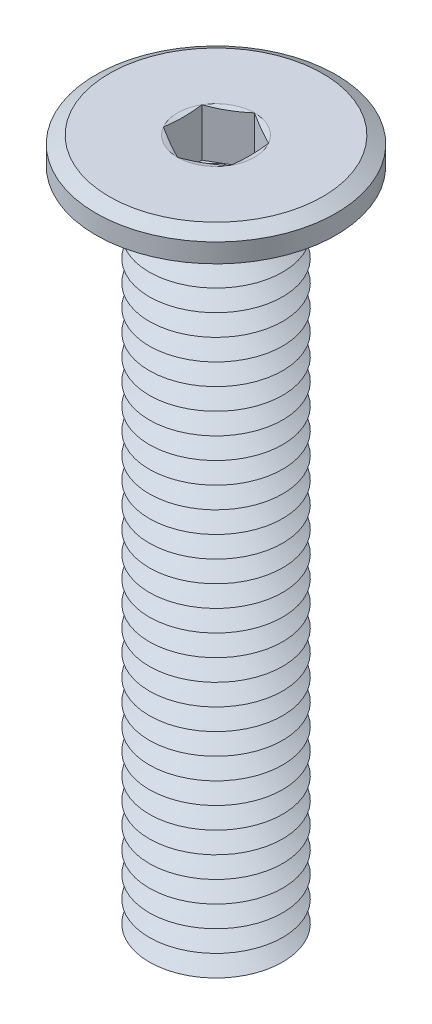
ISO-10303-21;
HEADER;
FILE_DESCRIPTION(('STEP AP214'),'2;1');
FILE_NAME('part.step','',(''),(''),'','','');
FILE_SCHEMA(('AUTOMOTIVE_DESIGN { 1 0 10303 214 1 1 1 1 }'));
ENDSEC;
DATA;
#1=APPLICATION_CONTEXT('core data for automotive mechanical design processes');
#2=APPLICATION_PROTOCOL_DEFINITION('international standard','automotive_design',2000,#1);
#3=PRODUCT_CONTEXT('',#1,'mechanical');
#4=PRODUCT('Part','Part','',(#3));
#5=PRODUCT_RELATED_PRODUCT_CATEGORY('part','',(#4));
#6=PRODUCT_DEFINITION_FORMATION('','',#4);
#7=PRODUCT_DEFINITION_CONTEXT('part definition',#1,'design');
#8=PRODUCT_DEFINITION('design','',#6,#7);
#9=PRODUCT_DEFINITION_SHAPE('','',#8);
#10=(LENGTH_UNIT() NAMED_UNIT(*) SI_UNIT(.MILLI.,.METRE.));
#11=(NAMED_UNIT(*) PLANE_ANGLE_UNIT() SI_UNIT($,.RADIAN.));
#12=(NAMED_UNIT(*) SI_UNIT($,.STERADIAN.) SOLID_ANGLE_UNIT());
#13=UNCERTAINTY_MEASURE_WITH_UNIT(LENGTH_MEASURE(1.E-05),#10,'distance_accuracy_value','');
#14=(GEOMETRIC_REPRESENTATION_CONTEXT(3) GLOBAL_UNCERTAINTY_ASSIGNED_CONTEXT((#13)) GLOBAL_UNIT_ASSIGNED_CONTEXT((#10,
#11,#12)) REPRESENTATION_CONTEXT('',''));
#15=CARTESIAN_POINT('',(0.,0.,0.));
#16=DIRECTION('',(0.,0.,1.));
#17=DIRECTION('',(1.,0.,0.));
#18=AXIS2_PLACEMENT_3D('',#15,#16,#17);
#19=CARTESIAN_POINT('',(0.,-24.8,0.));
#20=DIRECTION('',(0.,-1.,0.));
#21=DIRECTION('',(0.,0.,-1.));
#22=AXIS2_PLACEMENT_3D('',#19,#20,#21);
#23=CONICAL_SURFACE('',#22,2.5,1.0471975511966);
#24=CARTESIAN_POINT('',(0.,-24.4,0.));
#25=DIRECTION('',(0.,1.,0.));
#26=DIRECTION('',(0.,0.,1.));
#27=AXIS2_PLACEMENT_3D('',#24,#25,#26);
#28=CIRCLE('',#27,1.80717967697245);
#29=CARTESIAN_POINT('',(0.,-24.4,1.80717967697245));
#30=VERTEX_POINT('',#29);
#31=EDGE_CURVE('E592',#30,#30,#28,.T.);
#32=ORIENTED_EDGE('',*,*,#31,.F.);
#33=EDGE_LOOP('',(#32));
#34=FACE_BOUND('',#33,.T.);
#35=CARTESIAN_POINT('',(0.,-24.8,0.));
#36=DIRECTION('',(0.,1.,0.));
#37=DIRECTION('',(0.,0.,1.));
#38=AXIS2_PLACEMENT_3D('',#35,#36,#37);
#39=CIRCLE('',#38,2.5);
#40=CARTESIAN_POINT('',(0.,-24.8,2.5));
#41=VERTEX_POINT('',#40);
#42=EDGE_CURVE('E596',#41,#41,#39,.T.);
#43=ORIENTED_EDGE('',*,*,#42,.T.);
#44=EDGE_LOOP('',(#43));
#45=FACE_BOUND('',#44,.T.);
#46=ADVANCED_FACE('F39',(#34,#45),#23,.T.);
#47=CARTESIAN_POINT('',(0.,-24.4,0.));
#48=DIRECTION('',(0.,1.,0.));
#49=DIRECTION('',(0.,0.,1.));
#50=AXIS2_PLACEMENT_3D('',#47,#48,#49);
#51=CONICAL_SURFACE('',#50,1.80717967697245,1.04719755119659);
#52=CARTESIAN_POINT('',(0.,-24.,0.));
#53=DIRECTION('',(0.,1.,0.));
#54=DIRECTION('',(0.,0.,1.));
#55=AXIS2_PLACEMENT_3D('',#52,#53,#54);
#56=CIRCLE('',#55,2.5);
#57=CARTESIAN_POINT('',(0.,-24.,2.5));
#58=VERTEX_POINT('',#57);
#59=EDGE_CURVE('E588',#58,#58,#56,.T.);
#60=ORIENTED_EDGE('',*,*,#59,.F.);
#61=EDGE_LOOP('',(#60));
#62=FACE_BOUND('',#61,.T.);
#63=ORIENTED_EDGE('',*,*,#31,.T.);
#64=EDGE_LOOP('',(#63));
#65=FACE_BOUND('',#64,.T.);
#66=ADVANCED_FACE('F232',(#62,#65),#51,.T.);
#67=CARTESIAN_POINT('',(0.,-26.,0.));
#68=DIRECTION('',(0.,-1.,0.));
#69=DIRECTION('',(0.,0.,-1.));
#70=AXIS2_PLACEMENT_3D('',#67,#68,#69);
#71=PLANE('',#70);
#72=CARTESIAN_POINT('',(0.,-26.,0.));
#73=DIRECTION('',(0.,1.,0.));
#74=DIRECTION('',(0.,0.,1.));
#75=AXIS2_PLACEMENT_3D('',#72,#73,#74);
#76=CIRCLE('',#75,1.80717967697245);
#77=CARTESIAN_POINT('',(0.,-26.,1.80717967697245));
#78=VERTEX_POINT('',#77);
#79=EDGE_CURVE('E299',#78,#78,#76,.T.);
#80=ORIENTED_EDGE('',*,*,#79,.F.);
#81=EDGE_LOOP('',(#80));
#82=FACE_BOUND('',#81,.T.);
#83=ADVANCED_FACE('F238',(#82),#71,.T.);
#84=CARTESIAN_POINT('',(0.,-26.,0.));
#85=DIRECTION('',(0.,1.,0.));
#86=DIRECTION('',(0.,0.,1.));
#87=AXIS2_PLACEMENT_3D('',#84,#85,#86);
#88=CONICAL_SURFACE('',#87,1.80717967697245,1.04719755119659);
#89=CARTESIAN_POINT('',(0.,-25.6,0.));
#90=DIRECTION('',(0.,1.,0.));
#91=DIRECTION('',(0.,0.,1.));
#92=AXIS2_PLACEMENT_3D('',#89,#90,#91);
#93=CIRCLE('',#92,2.5);
#94=CARTESIAN_POINT('',(0.,-25.6,2.5));
#95=VERTEX_POINT('',#94);
#96=EDGE_CURVE('E604',#95,#95,#93,.T.);
#97=ORIENTED_EDGE('',*,*,#96,.F.);
#98=EDGE_LOOP('',(#97));
#99=FACE_BOUND('',#98,.T.);
#100=ORIENTED_EDGE('',*,*,#79,.T.);
#101=EDGE_LOOP('',(#100));
#102=FACE_BOUND('',#101,.T.);
#103=ADVANCED_FACE('F253',(#99,#102),#88,.T.);
#104=CARTESIAN_POINT('',(0.,-25.6,0.));
#105=DIRECTION('',(0.,-1.,0.));
#106=DIRECTION('',(0.,0.,-1.));
#107=AXIS2_PLACEMENT_3D('',#104,#105,#106);
#108=CONICAL_SURFACE('',#107,2.5,1.0471975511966);
#109=CARTESIAN_POINT('',(0.,-25.2,0.));
#110=DIRECTION('',(0.,1.,0.));
#111=DIRECTION('',(0.,0.,1.));
#112=AXIS2_PLACEMENT_3D('',#109,#110,#111);
#113=CIRCLE('',#112,1.80717967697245);
#114=CARTESIAN_POINT('',(0.,-25.2,1.80717967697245));
#115=VERTEX_POINT('',#114);
#116=EDGE_CURVE('E600',#115,#115,#113,.T.);
#117=ORIENTED_EDGE('',*,*,#116,.F.);
#118=EDGE_LOOP('',(#117));
#119=FACE_BOUND('',#118,.T.);
#120=ORIENTED_EDGE('',*,*,#96,.T.);
#121=EDGE_LOOP('',(#120));
#122=FACE_BOUND('',#121,.T.);
#123=ADVANCED_FACE('F249',(#119,#122),#108,.T.);
#124=CARTESIAN_POINT('',(0.,-25.2,0.));
#125=DIRECTION('',(0.,1.,0.));
#126=DIRECTION('',(0.,0.,1.));
#127=AXIS2_PLACEMENT_3D('',#124,#125,#126);
#128=CONICAL_SURFACE('',#127,1.80717967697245,1.04719755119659);
#129=ORIENTED_EDGE('',*,*,#42,.F.);
#130=EDGE_LOOP('',(#129));
#131=FACE_BOUND('',#130,.T.);
#132=ORIENTED_EDGE('',*,*,#116,.T.);
#133=EDGE_LOOP('',(#132));
#134=FACE_BOUND('',#133,.T.);
#135=ADVANCED_FACE('F245',(#131,#134),#128,.T.);
#136=CARTESIAN_POINT('',(0.,-24.,0.));
#137=DIRECTION('',(0.,-1.,0.));
#138=DIRECTION('',(0.,0.,-1.));
#139=AXIS2_PLACEMENT_3D('',#136,#137,#138);
#140=CONICAL_SURFACE('',#139,2.5,1.0471975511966);
#141=CARTESIAN_POINT('',(0.,-23.6,0.));
#142=DIRECTION('',(0.,1.,0.));
#143=DIRECTION('',(0.,0.,1.));
#144=AXIS2_PLACEMENT_3D('',#141,#142,#143);
#145=CIRCLE('',#144,1.80717967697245);
#146=CARTESIAN_POINT('',(0.,-23.6,1.80717967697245));
#147=VERTEX_POINT('',#146);
#148=EDGE_CURVE('E584',#147,#147,#145,.T.);
#149=ORIENTED_EDGE('',*,*,#148,.F.);
#150=EDGE_LOOP('',(#149));
#151=FACE_BOUND('',#150,.T.);
#152=ORIENTED_EDGE('',*,*,#59,.T.);
#153=EDGE_LOOP('',(#152));
#154=FACE_BOUND('',#153,.T.);
#155=ADVANCED_FACE('F248',(#151,#154),#140,.T.);
#156=CARTESIAN_POINT('',(0.,-23.6,0.));
#157=DIRECTION('',(0.,1.,0.));
#158=DIRECTION('',(0.,0.,1.));
#159=AXIS2_PLACEMENT_3D('',#156,#157,#158);
#160=CONICAL_SURFACE('',#159,1.80717967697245,1.04719755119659);
#161=CARTESIAN_POINT('',(0.,-23.2,0.));
#162=DIRECTION('',(0.,1.,0.));
#163=DIRECTION('',(0.,0.,1.));
#164=AXIS2_PLACEMENT_3D('',#161,#162,#163);
#165=CIRCLE('',#164,2.5);
#166=CARTESIAN_POINT('',(0.,-23.2,2.5));
#167=VERTEX_POINT('',#166);
#168=EDGE_CURVE('E580',#167,#167,#165,.T.);
#169=ORIENTED_EDGE('',*,*,#168,.F.);
#170=EDGE_LOOP('',(#169));
#171=FACE_BOUND('',#170,.T.);
#172=ORIENTED_EDGE('',*,*,#148,.T.);
#173=EDGE_LOOP('',(#172));
#174=FACE_BOUND('',#173,.T.);
#175=ADVANCED_FACE('F874',(#171,#174),#160,.T.);
#176=CARTESIAN_POINT('',(0.,-23.2,0.));
#177=DIRECTION('',(0.,-1.,0.));
#178=DIRECTION('',(0.,0.,-1.));
#179=AXIS2_PLACEMENT_3D('',#176,#177,#178);
#180=CONICAL_SURFACE('',#179,2.5,1.0471975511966);
#181=CARTESIAN_POINT('',(0.,-22.8,0.));
#182=DIRECTION('',(0.,1.,0.));
#183=DIRECTION('',(0.,0.,1.));
#184=AXIS2_PLACEMENT_3D('',#181,#182,#183);
#185=CIRCLE('',#184,1.80717967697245);
#186=CARTESIAN_POINT('',(0.,-22.8,1.80717967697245));
#187=VERTEX_POINT('',#186);
#188=EDGE_CURVE('E576',#187,#187,#185,.T.);
#189=ORIENTED_EDGE('',*,*,#188,.F.);
#190=EDGE_LOOP('',(#189));
#191=FACE_BOUND('',#190,.T.);
#192=ORIENTED_EDGE('',*,*,#168,.T.);
#193=EDGE_LOOP('',(#192));
#194=FACE_BOUND('',#193,.T.);
#195=ADVANCED_FACE('F870',(#191,#194),#180,.T.);
#196=CARTESIAN_POINT('',(0.,-22.8,0.));
#197=DIRECTION('',(0.,1.,0.));
#198=DIRECTION('',(0.,0.,1.));
#199=AXIS2_PLACEMENT_3D('',#196,#197,#198);
#200=CONICAL_SURFACE('',#199,1.80717967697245,1.04719755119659);
#201=CARTESIAN_POINT('',(0.,-22.4,0.));
#202=DIRECTION('',(0.,1.,0.));
#203=DIRECTION('',(0.,0.,1.));
#204=AXIS2_PLACEMENT_3D('',#201,#202,#203);
#205=CIRCLE('',#204,2.5);
#206=CARTESIAN_POINT('',(0.,-22.4,2.5));
#207=VERTEX_POINT('',#206);
#208=EDGE_CURVE('E572',#207,#207,#205,.T.);
#209=ORIENTED_EDGE('',*,*,#208,.F.);
#210=EDGE_LOOP('',(#209));
#211=FACE_BOUND('',#210,.T.);
#212=ORIENTED_EDGE('',*,*,#188,.T.);
#213=EDGE_LOOP('',(#212));
#214=FACE_BOUND('',#213,.T.);
#215=ADVANCED_FACE('F866',(#211,#214),#200,.T.);
#216=CARTESIAN_POINT('',(0.,-22.4,0.));
#217=DIRECTION('',(0.,-1.,0.));
#218=DIRECTION('',(0.,0.,-1.));
#219=AXIS2_PLACEMENT_3D('',#216,#217,#218);
#220=CONICAL_SURFACE('',#219,2.5,1.0471975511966);
#221=CARTESIAN_POINT('',(0.,-22.,0.));
#222=DIRECTION('',(0.,1.,0.));
#223=DIRECTION('',(0.,0.,1.));
#224=AXIS2_PLACEMENT_3D('',#221,#222,#223);
#225=CIRCLE('',#224,1.80717967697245);
#226=CARTESIAN_POINT('',(0.,-22.,1.80717967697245));
#227=VERTEX_POINT('',#226);
#228=EDGE_CURVE('E568',#227,#227,#225,.T.);
#229=ORIENTED_EDGE('',*,*,#228,.F.);
#230=EDGE_LOOP('',(#229));
#231=FACE_BOUND('',#230,.T.);
#232=ORIENTED_EDGE('',*,*,#208,.T.);
#233=EDGE_LOOP('',(#232));
#234=FACE_BOUND('',#233,.T.);
#235=ADVANCED_FACE('F862',(#231,#234),#220,.T.);
#236=CARTESIAN_POINT('',(0.,-22.,0.));
#237=DIRECTION('',(0.,1.,0.));
#238=DIRECTION('',(0.,0.,1.));
#239=AXIS2_PLACEMENT_3D('',#236,#237,#238);
#240=CONICAL_SURFACE('',#239,1.80717967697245,1.04719755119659);
#241=CARTESIAN_POINT('',(0.,-21.6,0.));
#242=DIRECTION('',(0.,1.,0.));
#243=DIRECTION('',(0.,0.,1.));
#244=AXIS2_PLACEMENT_3D('',#241,#242,#243);
#245=CIRCLE('',#244,2.5);
#246=CARTESIAN_POINT('',(0.,-21.6,2.5));
#247=VERTEX_POINT('',#246);
#248=EDGE_CURVE('E564',#247,#247,#245,.T.);
#249=ORIENTED_EDGE('',*,*,#248,.F.);
#250=EDGE_LOOP('',(#249));
#251=FACE_BOUND('',#250,.T.);
#252=ORIENTED_EDGE('',*,*,#228,.T.);
#253=EDGE_LOOP('',(#252));
#254=FACE_BOUND('',#253,.T.);
#255=ADVANCED_FACE('F858',(#251,#254),#240,.T.);
#256=CARTESIAN_POINT('',(0.,-21.6,0.));
#257=DIRECTION('',(0.,-1.,0.));
#258=DIRECTION('',(0.,0.,-1.));
#259=AXIS2_PLACEMENT_3D('',#256,#257,#258);
#260=CONICAL_SURFACE('',#259,2.5,1.0471975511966);
#261=CARTESIAN_POINT('',(0.,-21.2,0.));
#262=DIRECTION('',(0.,1.,0.));
#263=DIRECTION('',(0.,0.,1.));
#264=AXIS2_PLACEMENT_3D('',#261,#262,#263);
#265=CIRCLE('',#264,1.80717967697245);
#266=CARTESIAN_POINT('',(0.,-21.2,1.80717967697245));
#267=VERTEX_POINT('',#266);
#268=EDGE_CURVE('E560',#267,#267,#265,.T.);
#269=ORIENTED_EDGE('',*,*,#268,.F.);
#270=EDGE_LOOP('',(#269));
#271=FACE_BOUND('',#270,.T.);
#272=ORIENTED_EDGE('',*,*,#248,.T.);
#273=EDGE_LOOP('',(#272));
#274=FACE_BOUND('',#273,.T.);
#275=ADVANCED_FACE('F854',(#271,#274),#260,.T.);
#276=CARTESIAN_POINT('',(0.,-21.2,0.));
#277=DIRECTION('',(0.,1.,0.));
#278=DIRECTION('',(0.,0.,1.));
#279=AXIS2_PLACEMENT_3D('',#276,#277,#278);
#280=CONICAL_SURFACE('',#279,1.80717967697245,1.04719755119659);
#281=CARTESIAN_POINT('',(0.,-20.8,0.));
#282=DIRECTION('',(0.,1.,0.));
#283=DIRECTION('',(0.,0.,1.));
#284=AXIS2_PLACEMENT_3D('',#281,#282,#283);
#285=CIRCLE('',#284,2.5);
#286=CARTESIAN_POINT('',(0.,-20.8,2.5));
#287=VERTEX_POINT('',#286);
#288=EDGE_CURVE('E557',#287,#287,#285,.T.);
#289=ORIENTED_EDGE('',*,*,#288,.F.);
#290=EDGE_LOOP('',(#289));
#291=FACE_BOUND('',#290,.T.);
#292=ORIENTED_EDGE('',*,*,#268,.T.);
#293=EDGE_LOOP('',(#292));
#294=FACE_BOUND('',#293,.T.);
#295=ADVANCED_FACE('F850',(#291,#294),#280,.T.);
#296=CARTESIAN_POINT('',(0.,-20.8,0.));
#297=DIRECTION('',(0.,-1.,0.));
#298=DIRECTION('',(0.,0.,-1.));
#299=AXIS2_PLACEMENT_3D('',#296,#297,#298);
#300=CONICAL_SURFACE('',#299,2.5,1.0471975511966);
#301=CARTESIAN_POINT('',(0.,-20.4,0.));
#302=DIRECTION('',(0.,1.,0.));
#303=DIRECTION('',(0.,0.,1.));
#304=AXIS2_PLACEMENT_3D('',#301,#302,#303);
#305=CIRCLE('',#304,1.80717967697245);
#306=CARTESIAN_POINT('',(0.,-20.4,1.80717967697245));
#307=VERTEX_POINT('',#306);
#308=EDGE_CURVE('E553',#307,#307,#305,.T.);
#309=ORIENTED_EDGE('',*,*,#308,.F.);
#310=EDGE_LOOP('',(#309));
#311=FACE_BOUND('',#310,.T.);
#312=ORIENTED_EDGE('',*,*,#288,.T.);
#313=EDGE_LOOP('',(#312));
#314=FACE_BOUND('',#313,.T.);
#315=ADVANCED_FACE('F846',(#311,#314),#300,.T.);
#316=CARTESIAN_POINT('',(0.,-20.4,0.));
#317=DIRECTION('',(0.,1.,0.));
#318=DIRECTION('',(0.,0.,1.));
#319=AXIS2_PLACEMENT_3D('',#316,#317,#318);
#320=CONICAL_SURFACE('',#319,1.80717967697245,1.04719755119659);
#321=CARTESIAN_POINT('',(0.,-20.,0.));
#322=DIRECTION('',(0.,1.,0.));
#323=DIRECTION('',(0.,0.,1.));
#324=AXIS2_PLACEMENT_3D('',#321,#322,#323);
#325=CIRCLE('',#324,2.5);
#326=CARTESIAN_POINT('',(0.,-20.,2.5));
#327=VERTEX_POINT('',#326);
#328=EDGE_CURVE('E549',#327,#327,#325,.T.);
#329=ORIENTED_EDGE('',*,*,#328,.F.);
#330=EDGE_LOOP('',(#329));
#331=FACE_BOUND('',#330,.T.);
#332=ORIENTED_EDGE('',*,*,#308,.T.);
#333=EDGE_LOOP('',(#332));
#334=FACE_BOUND('',#333,.T.);
#335=ADVANCED_FACE('F842',(#331,#334),#320,.T.);
#336=CARTESIAN_POINT('',(0.,-20.,0.));
#337=DIRECTION('',(0.,-1.,0.));
#338=DIRECTION('',(0.,0.,-1.));
#339=AXIS2_PLACEMENT_3D('',#336,#337,#338);
#340=CONICAL_SURFACE('',#339,2.5,1.0471975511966);
#341=CARTESIAN_POINT('',(0.,-19.6,0.));
#342=DIRECTION('',(0.,1.,0.));
#343=DIRECTION('',(0.,0.,1.));
#344=AXIS2_PLACEMENT_3D('',#341,#342,#343);
#345=CIRCLE('',#344,1.80717967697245);
#346=CARTESIAN_POINT('',(0.,-19.6,1.80717967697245));
#347=VERTEX_POINT('',#346);
#348=EDGE_CURVE('E545',#347,#347,#345,.T.);
#349=ORIENTED_EDGE('',*,*,#348,.F.);
#350=EDGE_LOOP('',(#349));
#351=FACE_BOUND('',#350,.T.);
#352=ORIENTED_EDGE('',*,*,#328,.T.);
#353=EDGE_LOOP('',(#352));
#354=FACE_BOUND('',#353,.T.);
#355=ADVANCED_FACE('F838',(#351,#354),#340,.T.);
#356=CARTESIAN_POINT('',(0.,-19.6,0.));
#357=DIRECTION('',(0.,1.,0.));
#358=DIRECTION('',(0.,0.,1.));
#359=AXIS2_PLACEMENT_3D('',#356,#357,#358);
#360=CONICAL_SURFACE('',#359,1.80717967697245,1.04719755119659);
#361=CARTESIAN_POINT('',(0.,-19.2,0.));
#362=DIRECTION('',(0.,1.,0.));
#363=DIRECTION('',(0.,0.,1.));
#364=AXIS2_PLACEMENT_3D('',#361,#362,#363);
#365=CIRCLE('',#364,2.5);
#366=CARTESIAN_POINT('',(0.,-19.2,2.5));
#367=VERTEX_POINT('',#366);
#368=EDGE_CURVE('E541',#367,#367,#365,.T.);
#369=ORIENTED_EDGE('',*,*,#368,.F.);
#370=EDGE_LOOP('',(#369));
#371=FACE_BOUND('',#370,.T.);
#372=ORIENTED_EDGE('',*,*,#348,.T.);
#373=EDGE_LOOP('',(#372));
#374=FACE_BOUND('',#373,.T.);
#375=ADVANCED_FACE('F834',(#371,#374),#360,.T.);
#376=CARTESIAN_POINT('',(0.,-19.2,0.));
#377=DIRECTION('',(0.,-1.,0.));
#378=DIRECTION('',(0.,0.,-1.));
#379=AXIS2_PLACEMENT_3D('',#376,#377,#378);
#380=CONICAL_SURFACE('',#379,2.5,1.0471975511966);
#381=CARTESIAN_POINT('',(0.,-18.8,0.));
#382=DIRECTION('',(0.,1.,0.));
#383=DIRECTION('',(0.,0.,1.));
#384=AXIS2_PLACEMENT_3D('',#381,#382,#383);
#385=CIRCLE('',#384,1.80717967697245);
#386=CARTESIAN_POINT('',(0.,-18.8,1.80717967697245));
#387=VERTEX_POINT('',#386);
#388=EDGE_CURVE('E537',#387,#387,#385,.T.);
#389=ORIENTED_EDGE('',*,*,#388,.F.);
#390=EDGE_LOOP('',(#389));
#391=FACE_BOUND('',#390,.T.);
#392=ORIENTED_EDGE('',*,*,#368,.T.);
#393=EDGE_LOOP('',(#392));
#394=FACE_BOUND('',#393,.T.);
#395=ADVANCED_FACE('F830',(#391,#394),#380,.T.);
#396=CARTESIAN_POINT('',(0.,-18.8,0.));
#397=DIRECTION('',(0.,1.,0.));
#398=DIRECTION('',(0.,0.,1.));
#399=AXIS2_PLACEMENT_3D('',#396,#397,#398);
#400=CONICAL_SURFACE('',#399,1.80717967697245,1.04719755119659);
#401=CARTESIAN_POINT('',(0.,-18.4,0.));
#402=DIRECTION('',(0.,1.,0.));
#403=DIRECTION('',(0.,0.,1.));
#404=AXIS2_PLACEMENT_3D('',#401,#402,#403);
#405=CIRCLE('',#404,2.5);
#406=CARTESIAN_POINT('',(0.,-18.4,2.5));
#407=VERTEX_POINT('',#406);
#408=EDGE_CURVE('E533',#407,#407,#405,.T.);
#409=ORIENTED_EDGE('',*,*,#408,.F.);
#410=EDGE_LOOP('',(#409));
#411=FACE_BOUND('',#410,.T.);
#412=ORIENTED_EDGE('',*,*,#388,.T.);
#413=EDGE_LOOP('',(#412));
#414=FACE_BOUND('',#413,.T.);
#415=ADVANCED_FACE('F826',(#411,#414),#400,.T.);
#416=CARTESIAN_POINT('',(0.,-18.4,0.));
#417=DIRECTION('',(0.,-1.,0.));
#418=DIRECTION('',(0.,0.,-1.));
#419=AXIS2_PLACEMENT_3D('',#416,#417,#418);
#420=CONICAL_SURFACE('',#419,2.5,1.0471975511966);
#421=CARTESIAN_POINT('',(0.,-18.,0.));
#422=DIRECTION('',(0.,1.,0.));
#423=DIRECTION('',(0.,0.,1.));
#424=AXIS2_PLACEMENT_3D('',#421,#422,#423);
#425=CIRCLE('',#424,1.80717967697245);
#426=CARTESIAN_POINT('',(0.,-18.,1.80717967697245));
#427=VERTEX_POINT('',#426);
#428=EDGE_CURVE('E529',#427,#427,#425,.T.);
#429=ORIENTED_EDGE('',*,*,#428,.F.);
#430=EDGE_LOOP('',(#429));
#431=FACE_BOUND('',#430,.T.);
#432=ORIENTED_EDGE('',*,*,#408,.T.);
#433=EDGE_LOOP('',(#432));
#434=FACE_BOUND('',#433,.T.);
#435=ADVANCED_FACE('F822',(#431,#434),#420,.T.);
#436=CARTESIAN_POINT('',(0.,-18.,0.));
#437=DIRECTION('',(0.,1.,0.));
#438=DIRECTION('',(0.,0.,1.));
#439=AXIS2_PLACEMENT_3D('',#436,#437,#438);
#440=CONICAL_SURFACE('',#439,1.80717967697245,1.04719755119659);
#441=CARTESIAN_POINT('',(0.,-17.6,0.));
#442=DIRECTION('',(0.,1.,0.));
#443=DIRECTION('',(0.,0.,1.));
#444=AXIS2_PLACEMENT_3D('',#441,#442,#443);
#445=CIRCLE('',#444,2.5);
#446=CARTESIAN_POINT('',(0.,-17.6,2.5));
#447=VERTEX_POINT('',#446);
#448=EDGE_CURVE('E525',#447,#447,#445,.T.);
#449=ORIENTED_EDGE('',*,*,#448,.F.);
#450=EDGE_LOOP('',(#449));
#451=FACE_BOUND('',#450,.T.);
#452=ORIENTED_EDGE('',*,*,#428,.T.);
#453=EDGE_LOOP('',(#452));
#454=FACE_BOUND('',#453,.T.);
#455=ADVANCED_FACE('F818',(#451,#454),#440,.T.);
#456=CARTESIAN_POINT('',(0.,-17.6,0.));
#457=DIRECTION('',(0.,-1.,0.));
#458=DIRECTION('',(0.,0.,-1.));
#459=AXIS2_PLACEMENT_3D('',#456,#457,#458);
#460=CONICAL_SURFACE('',#459,2.5,1.0471975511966);
#461=CARTESIAN_POINT('',(0.,-17.2,0.));
#462=DIRECTION('',(0.,1.,0.));
#463=DIRECTION('',(0.,0.,1.));
#464=AXIS2_PLACEMENT_3D('',#461,#462,#463);
#465=CIRCLE('',#464,1.80717967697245);
#466=CARTESIAN_POINT('',(0.,-17.2,1.80717967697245));
#467=VERTEX_POINT('',#466);
#468=EDGE_CURVE('E521',#467,#467,#465,.T.);
#469=ORIENTED_EDGE('',*,*,#468,.F.);
#470=EDGE_LOOP('',(#469));
#471=FACE_BOUND('',#470,.T.);
#472=ORIENTED_EDGE('',*,*,#448,.T.);
#473=EDGE_LOOP('',(#472));
#474=FACE_BOUND('',#473,.T.);
#475=ADVANCED_FACE('F814',(#471,#474),#460,.T.);
#476=CARTESIAN_POINT('',(0.,-17.2,0.));
#477=DIRECTION('',(0.,1.,0.));
#478=DIRECTION('',(0.,0.,1.));
#479=AXIS2_PLACEMENT_3D('',#476,#477,#478);
#480=CONICAL_SURFACE('',#479,1.80717967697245,1.04719755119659);
#481=CARTESIAN_POINT('',(0.,-16.8,0.));
#482=DIRECTION('',(0.,1.,0.));
#483=DIRECTION('',(0.,0.,1.));
#484=AXIS2_PLACEMENT_3D('',#481,#482,#483);
#485=CIRCLE('',#484,2.5);
#486=CARTESIAN_POINT('',(0.,-16.8,2.5));
#487=VERTEX_POINT('',#486);
#488=EDGE_CURVE('E517',#487,#487,#485,.T.);
#489=ORIENTED_EDGE('',*,*,#488,.F.);
#490=EDGE_LOOP('',(#489));
#491=FACE_BOUND('',#490,.T.);
#492=ORIENTED_EDGE('',*,*,#468,.T.);
#493=EDGE_LOOP('',(#492));
#494=FACE_BOUND('',#493,.T.);
#495=ADVANCED_FACE('F810',(#491,#494),#480,.T.);
#496=CARTESIAN_POINT('',(0.,-16.8,0.));
#497=DIRECTION('',(0.,-1.,0.));
#498=DIRECTION('',(0.,0.,-1.));
#499=AXIS2_PLACEMENT_3D('',#496,#497,#498);
#500=CONICAL_SURFACE('',#499,2.5,1.0471975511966);
#501=CARTESIAN_POINT('',(0.,-16.4,0.));
#502=DIRECTION('',(0.,1.,0.));
#503=DIRECTION('',(0.,0.,1.));
#504=AXIS2_PLACEMENT_3D('',#501,#502,#503);
#505=CIRCLE('',#504,1.80717967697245);
#506=CARTESIAN_POINT('',(0.,-16.4,1.80717967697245));
#507=VERTEX_POINT('',#506);
#508=EDGE_CURVE('E513',#507,#507,#505,.T.);
#509=ORIENTED_EDGE('',*,*,#508,.F.);
#510=EDGE_LOOP('',(#509));
#511=FACE_BOUND('',#510,.T.);
#512=ORIENTED_EDGE('',*,*,#488,.T.);
#513=EDGE_LOOP('',(#512));
#514=FACE_BOUND('',#513,.T.);
#515=ADVANCED_FACE('F806',(#511,#514),#500,.T.);
#516=CARTESIAN_POINT('',(0.,-16.4,0.));
#517=DIRECTION('',(0.,1.,0.));
#518=DIRECTION('',(0.,0.,1.));
#519=AXIS2_PLACEMENT_3D('',#516,#517,#518);
#520=CONICAL_SURFACE('',#519,1.80717967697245,1.04719755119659);
#521=CARTESIAN_POINT('',(0.,-16.,0.));
#522=DIRECTION('',(0.,1.,0.));
#523=DIRECTION('',(0.,0.,1.));
#524=AXIS2_PLACEMENT_3D('',#521,#522,#523);
#525=CIRCLE('',#524,2.5);
#526=CARTESIAN_POINT('',(0.,-16.,2.5));
#527=VERTEX_POINT('',#526);
#528=EDGE_CURVE('E509',#527,#527,#525,.T.);
#529=ORIENTED_EDGE('',*,*,#528,.F.);
#530=EDGE_LOOP('',(#529));
#531=FACE_BOUND('',#530,.T.);
#532=ORIENTED_EDGE('',*,*,#508,.T.);
#533=EDGE_LOOP('',(#532));
#534=FACE_BOUND('',#533,.T.);
#535=ADVANCED_FACE('F802',(#531,#534),#520,.T.);
#536=CARTESIAN_POINT('',(0.,-16.,0.));
#537=DIRECTION('',(0.,-1.,0.));
#538=DIRECTION('',(0.,0.,-1.));
#539=AXIS2_PLACEMENT_3D('',#536,#537,#538);
#540=CONICAL_SURFACE('',#539,2.5,1.0471975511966);
#541=CARTESIAN_POINT('',(0.,-15.6,0.));
#542=DIRECTION('',(0.,1.,0.));
#543=DIRECTION('',(0.,0.,1.));
#544=AXIS2_PLACEMENT_3D('',#541,#542,#543);
#545=CIRCLE('',#544,1.80717967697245);
#546=CARTESIAN_POINT('',(0.,-15.6,1.80717967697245));
#547=VERTEX_POINT('',#546);
#548=EDGE_CURVE('E505',#547,#547,#545,.T.);
#549=ORIENTED_EDGE('',*,*,#548,.F.);
#550=EDGE_LOOP('',(#549));
#551=FACE_BOUND('',#550,.T.);
#552=ORIENTED_EDGE('',*,*,#528,.T.);
#553=EDGE_LOOP('',(#552));
#554=FACE_BOUND('',#553,.T.);
#555=ADVANCED_FACE('F798',(#551,#554),#540,.T.);
#556=CARTESIAN_POINT('',(0.,-15.6,0.));
#557=DIRECTION('',(0.,1.,0.));
#558=DIRECTION('',(0.,0.,1.));
#559=AXIS2_PLACEMENT_3D('',#556,#557,#558);
#560=CONICAL_SURFACE('',#559,1.80717967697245,1.04719755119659);
#561=CARTESIAN_POINT('',(0.,-15.2,0.));
#562=DIRECTION('',(0.,1.,0.));
#563=DIRECTION('',(0.,0.,1.));
#564=AXIS2_PLACEMENT_3D('',#561,#562,#563);
#565=CIRCLE('',#564,2.5);
#566=CARTESIAN_POINT('',(0.,-15.2,2.5));
#567=VERTEX_POINT('',#566);
#568=EDGE_CURVE('E501',#567,#567,#565,.T.);
#569=ORIENTED_EDGE('',*,*,#568,.F.);
#570=EDGE_LOOP('',(#569));
#571=FACE_BOUND('',#570,.T.);
#572=ORIENTED_EDGE('',*,*,#548,.T.);
#573=EDGE_LOOP('',(#572));
#574=FACE_BOUND('',#573,.T.);
#575=ADVANCED_FACE('F794',(#571,#574),#560,.T.);
#576=CARTESIAN_POINT('',(0.,-15.2,0.));
#577=DIRECTION('',(0.,-1.,0.));
#578=DIRECTION('',(0.,0.,-1.));
#579=AXIS2_PLACEMENT_3D('',#576,#577,#578);
#580=CONICAL_SURFACE('',#579,2.5,1.0471975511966);
#581=CARTESIAN_POINT('',(0.,-14.8,0.));
#582=DIRECTION('',(0.,1.,0.));
#583=DIRECTION('',(0.,0.,1.));
#584=AXIS2_PLACEMENT_3D('',#581,#582,#583);
#585=CIRCLE('',#584,1.80717967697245);
#586=CARTESIAN_POINT('',(0.,-14.8,1.80717967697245));
#587=VERTEX_POINT('',#586);
#588=EDGE_CURVE('E497',#587,#587,#585,.T.);
#589=ORIENTED_EDGE('',*,*,#588,.F.);
#590=EDGE_LOOP('',(#589));
#591=FACE_BOUND('',#590,.T.);
#592=ORIENTED_EDGE('',*,*,#568,.T.);
#593=EDGE_LOOP('',(#592));
#594=FACE_BOUND('',#593,.T.);
#595=ADVANCED_FACE('F790',(#591,#594),#580,.T.);
#596=CARTESIAN_POINT('',(0.,-14.8,0.));
#597=DIRECTION('',(0.,1.,0.));
#598=DIRECTION('',(0.,0.,1.));
#599=AXIS2_PLACEMENT_3D('',#596,#597,#598);
#600=CONICAL_SURFACE('',#599,1.80717967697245,1.04719755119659);
#601=CARTESIAN_POINT('',(0.,-14.4,0.));
#602=DIRECTION('',(0.,1.,0.));
#603=DIRECTION('',(0.,0.,1.));
#604=AXIS2_PLACEMENT_3D('',#601,#602,#603);
#605=CIRCLE('',#604,2.5);
#606=CARTESIAN_POINT('',(0.,-14.4,2.5));
#607=VERTEX_POINT('',#606);
#608=EDGE_CURVE('E493',#607,#607,#605,.T.);
#609=ORIENTED_EDGE('',*,*,#608,.F.);
#610=EDGE_LOOP('',(#609));
#611=FACE_BOUND('',#610,.T.);
#612=ORIENTED_EDGE('',*,*,#588,.T.);
#613=EDGE_LOOP('',(#612));
#614=FACE_BOUND('',#613,.T.);
#615=ADVANCED_FACE('F786',(#611,#614),#600,.T.);
#616=CARTESIAN_POINT('',(0.,-14.4,0.));
#617=DIRECTION('',(0.,-1.,0.));
#618=DIRECTION('',(0.,0.,-1.));
#619=AXIS2_PLACEMENT_3D('',#616,#617,#618);
#620=CONICAL_SURFACE('',#619,2.5,1.0471975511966);
#621=CARTESIAN_POINT('',(0.,-14.,0.));
#622=DIRECTION('',(0.,1.,0.));
#623=DIRECTION('',(0.,0.,1.));
#624=AXIS2_PLACEMENT_3D('',#621,#622,#623);
#625=CIRCLE('',#624,1.80717967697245);
#626=CARTESIAN_POINT('',(0.,-14.,1.80717967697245));
#627=VERTEX_POINT('',#626);
#628=EDGE_CURVE('E489',#627,#627,#625,.T.);
#629=ORIENTED_EDGE('',*,*,#628,.F.);
#630=EDGE_LOOP('',(#629));
#631=FACE_BOUND('',#630,.T.);
#632=ORIENTED_EDGE('',*,*,#608,.T.);
#633=EDGE_LOOP('',(#632));
#634=FACE_BOUND('',#633,.T.);
#635=ADVANCED_FACE('F782',(#631,#634),#620,.T.);
#636=CARTESIAN_POINT('',(0.,-14.,0.));
#637=DIRECTION('',(0.,1.,0.));
#638=DIRECTION('',(0.,0.,1.));
#639=AXIS2_PLACEMENT_3D('',#636,#637,#638);
#640=CONICAL_SURFACE('',#639,1.80717967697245,1.04719755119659);
#641=CARTESIAN_POINT('',(0.,-13.6,0.));
#642=DIRECTION('',(0.,1.,0.));
#643=DIRECTION('',(0.,0.,1.));
#644=AXIS2_PLACEMENT_3D('',#641,#642,#643);
#645=CIRCLE('',#644,2.5);
#646=CARTESIAN_POINT('',(0.,-13.6,2.5));
#647=VERTEX_POINT('',#646);
#648=EDGE_CURVE('E485',#647,#647,#645,.T.);
#649=ORIENTED_EDGE('',*,*,#648,.F.);
#650=EDGE_LOOP('',(#649));
#651=FACE_BOUND('',#650,.T.);
#652=ORIENTED_EDGE('',*,*,#628,.T.);
#653=EDGE_LOOP('',(#652));
#654=FACE_BOUND('',#653,.T.);
#655=ADVANCED_FACE('F778',(#651,#654),#640,.T.);
#656=CARTESIAN_POINT('',(0.,-13.6,0.));
#657=DIRECTION('',(0.,-1.,0.));
#658=DIRECTION('',(0.,0.,-1.));
#659=AXIS2_PLACEMENT_3D('',#656,#657,#658);
#660=CONICAL_SURFACE('',#659,2.5,1.0471975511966);
#661=CARTESIAN_POINT('',(0.,-13.2,0.));
#662=DIRECTION('',(0.,1.,0.));
#663=DIRECTION('',(0.,0.,1.));
#664=AXIS2_PLACEMENT_3D('',#661,#662,#663);
#665=CIRCLE('',#664,1.80717967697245);
#666=CARTESIAN_POINT('',(0.,-13.2,1.80717967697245));
#667=VERTEX_POINT('',#666);
#668=EDGE_CURVE('E481',#667,#667,#665,.T.);
#669=ORIENTED_EDGE('',*,*,#668,.F.);
#670=EDGE_LOOP('',(#669));
#671=FACE_BOUND('',#670,.T.);
#672=ORIENTED_EDGE('',*,*,#648,.T.);
#673=EDGE_LOOP('',(#672));
#674=FACE_BOUND('',#673,.T.);
#675=ADVANCED_FACE('F774',(#671,#674),#660,.T.);
#676=CARTESIAN_POINT('',(0.,-13.2,0.));
#677=DIRECTION('',(0.,1.,0.));
#678=DIRECTION('',(0.,0.,1.));
#679=AXIS2_PLACEMENT_3D('',#676,#677,#678);
#680=CONICAL_SURFACE('',#679,1.80717967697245,1.04719755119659);
#681=CARTESIAN_POINT('',(0.,-12.8,0.));
#682=DIRECTION('',(0.,1.,0.));
#683=DIRECTION('',(0.,0.,1.));
#684=AXIS2_PLACEMENT_3D('',#681,#682,#683);
#685=CIRCLE('',#684,2.5);
#686=CARTESIAN_POINT('',(0.,-12.8,2.5));
#687=VERTEX_POINT('',#686);
#688=EDGE_CURVE('E477',#687,#687,#685,.T.);
#689=ORIENTED_EDGE('',*,*,#688,.F.);
#690=EDGE_LOOP('',(#689));
#691=FACE_BOUND('',#690,.T.);
#692=ORIENTED_EDGE('',*,*,#668,.T.);
#693=EDGE_LOOP('',(#692));
#694=FACE_BOUND('',#693,.T.);
#695=ADVANCED_FACE('F770',(#691,#694),#680,.T.);
#696=CARTESIAN_POINT('',(0.,-12.8,0.));
#697=DIRECTION('',(0.,-1.,0.));
#698=DIRECTION('',(0.,0.,-1.));
#699=AXIS2_PLACEMENT_3D('',#696,#697,#698);
#700=CONICAL_SURFACE('',#699,2.5,1.0471975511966);
#701=CARTESIAN_POINT('',(0.,-12.4,0.));
#702=DIRECTION('',(0.,1.,0.));
#703=DIRECTION('',(0.,0.,1.));
#704=AXIS2_PLACEMENT_3D('',#701,#702,#703);
#705=CIRCLE('',#704,1.80717967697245);
#706=CARTESIAN_POINT('',(0.,-12.4,1.80717967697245));
#707=VERTEX_POINT('',#706);
#708=EDGE_CURVE('E473',#707,#707,#705,.T.);
#709=ORIENTED_EDGE('',*,*,#708,.F.);
#710=EDGE_LOOP('',(#709));
#711=FACE_BOUND('',#710,.T.);
#712=ORIENTED_EDGE('',*,*,#688,.T.);
#713=EDGE_LOOP('',(#712));
#714=FACE_BOUND('',#713,.T.);
#715=ADVANCED_FACE('F766',(#711,#714),#700,.T.);
#716=CARTESIAN_POINT('',(0.,-12.4,0.));
#717=DIRECTION('',(0.,1.,0.));
#718=DIRECTION('',(0.,0.,1.));
#719=AXIS2_PLACEMENT_3D('',#716,#717,#718);
#720=CONICAL_SURFACE('',#719,1.80717967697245,1.04719755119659);
#721=CARTESIAN_POINT('',(0.,-12.,0.));
#722=DIRECTION('',(0.,1.,0.));
#723=DIRECTION('',(0.,0.,1.));
#724=AXIS2_PLACEMENT_3D('',#721,#722,#723);
#725=CIRCLE('',#724,2.5);
#726=CARTESIAN_POINT('',(0.,-12.,2.5));
#727=VERTEX_POINT('',#726);
#728=EDGE_CURVE('E469',#727,#727,#725,.T.);
#729=ORIENTED_EDGE('',*,*,#728,.F.);
#730=EDGE_LOOP('',(#729));
#731=FACE_BOUND('',#730,.T.);
#732=ORIENTED_EDGE('',*,*,#708,.T.);
#733=EDGE_LOOP('',(#732));
#734=FACE_BOUND('',#733,.T.);
#735=ADVANCED_FACE('F762',(#731,#734),#720,.T.);
#736=CARTESIAN_POINT('',(0.,-12.,0.));
#737=DIRECTION('',(0.,-1.,0.));
#738=DIRECTION('',(0.,0.,-1.));
#739=AXIS2_PLACEMENT_3D('',#736,#737,#738);
#740=CONICAL_SURFACE('',#739,2.5,1.0471975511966);
#741=CARTESIAN_POINT('',(0.,-11.6,0.));
#742=DIRECTION('',(0.,1.,0.));
#743=DIRECTION('',(0.,0.,1.));
#744=AXIS2_PLACEMENT_3D('',#741,#742,#743);
#745=CIRCLE('',#744,1.80717967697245);
#746=CARTESIAN_POINT('',(0.,-11.6,1.80717967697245));
#747=VERTEX_POINT('',#746);
#748=EDGE_CURVE('E466',#747,#747,#745,.T.);
#749=ORIENTED_EDGE('',*,*,#748,.F.);
#750=EDGE_LOOP('',(#749));
#751=FACE_BOUND('',#750,.T.);
#752=ORIENTED_EDGE('',*,*,#728,.T.);
#753=EDGE_LOOP('',(#752));
#754=FACE_BOUND('',#753,.T.);
#755=ADVANCED_FACE('F758',(#751,#754),#740,.T.);
#756=CARTESIAN_POINT('',(0.,-11.6,0.));
#757=DIRECTION('',(0.,1.,0.));
#758=DIRECTION('',(0.,0.,1.));
#759=AXIS2_PLACEMENT_3D('',#756,#757,#758);
#760=CONICAL_SURFACE('',#759,1.80717967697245,1.04719755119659);
#761=CARTESIAN_POINT('',(0.,-11.2,0.));
#762=DIRECTION('',(0.,1.,0.));
#763=DIRECTION('',(0.,0.,1.));
#764=AXIS2_PLACEMENT_3D('',#761,#762,#763);
#765=CIRCLE('',#764,2.5);
#766=CARTESIAN_POINT('',(0.,-11.2,2.5));
#767=VERTEX_POINT('',#766);
#768=EDGE_CURVE('E462',#767,#767,#765,.T.);
#769=ORIENTED_EDGE('',*,*,#768,.F.);
#770=EDGE_LOOP('',(#769));
#771=FACE_BOUND('',#770,.T.);
#772=ORIENTED_EDGE('',*,*,#748,.T.);
#773=EDGE_LOOP('',(#772));
#774=FACE_BOUND('',#773,.T.);
#775=ADVANCED_FACE('F754',(#771,#774),#760,.T.);
#776=CARTESIAN_POINT('',(0.,-11.2,0.));
#777=DIRECTION('',(0.,-1.,0.));
#778=DIRECTION('',(0.,0.,-1.));
#779=AXIS2_PLACEMENT_3D('',#776,#777,#778);
#780=CONICAL_SURFACE('',#779,2.5,1.0471975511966);
#781=CARTESIAN_POINT('',(0.,-10.8,0.));
#782=DIRECTION('',(0.,1.,0.));
#783=DIRECTION('',(0.,0.,1.));
#784=AXIS2_PLACEMENT_3D('',#781,#782,#783);
#785=CIRCLE('',#784,1.80717967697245);
#786=CARTESIAN_POINT('',(0.,-10.8,1.80717967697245));
#787=VERTEX_POINT('',#786);
#788=EDGE_CURVE('E458',#787,#787,#785,.T.);
#789=ORIENTED_EDGE('',*,*,#788,.F.);
#790=EDGE_LOOP('',(#789));
#791=FACE_BOUND('',#790,.T.);
#792=ORIENTED_EDGE('',*,*,#768,.T.);
#793=EDGE_LOOP('',(#792));
#794=FACE_BOUND('',#793,.T.);
#795=ADVANCED_FACE('F750',(#791,#794),#780,.T.);
#796=CARTESIAN_POINT('',(0.,-10.8,0.));
#797=DIRECTION('',(0.,1.,0.));
#798=DIRECTION('',(0.,0.,1.));
#799=AXIS2_PLACEMENT_3D('',#796,#797,#798);
#800=CONICAL_SURFACE('',#799,1.80717967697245,1.04719755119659);
#801=CARTESIAN_POINT('',(0.,-10.4,0.));
#802=DIRECTION('',(0.,1.,0.));
#803=DIRECTION('',(0.,0.,1.));
#804=AXIS2_PLACEMENT_3D('',#801,#802,#803);
#805=CIRCLE('',#804,2.5);
#806=CARTESIAN_POINT('',(0.,-10.4,2.5));
#807=VERTEX_POINT('',#806);
#808=EDGE_CURVE('E455',#807,#807,#805,.T.);
#809=ORIENTED_EDGE('',*,*,#808,.F.);
#810=EDGE_LOOP('',(#809));
#811=FACE_BOUND('',#810,.T.);
#812=ORIENTED_EDGE('',*,*,#788,.T.);
#813=EDGE_LOOP('',(#812));
#814=FACE_BOUND('',#813,.T.);
#815=ADVANCED_FACE('F746',(#811,#814),#800,.T.);
#816=CARTESIAN_POINT('',(0.,-10.4,0.));
#817=DIRECTION('',(0.,-1.,0.));
#818=DIRECTION('',(0.,0.,-1.));
#819=AXIS2_PLACEMENT_3D('',#816,#817,#818);
#820=CONICAL_SURFACE('',#819,2.5,1.0471975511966);
#821=CARTESIAN_POINT('',(0.,-10.,0.));
#822=DIRECTION('',(0.,1.,0.));
#823=DIRECTION('',(0.,0.,1.));
#824=AXIS2_PLACEMENT_3D('',#821,#822,#823);
#825=CIRCLE('',#824,1.80717967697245);
#826=CARTESIAN_POINT('',(0.,-10.,1.80717967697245));
#827=VERTEX_POINT('',#826);
#828=EDGE_CURVE('E451',#827,#827,#825,.T.);
#829=ORIENTED_EDGE('',*,*,#828,.F.);
#830=EDGE_LOOP('',(#829));
#831=FACE_BOUND('',#830,.T.);
#832=ORIENTED_EDGE('',*,*,#808,.T.);
#833=EDGE_LOOP('',(#832));
#834=FACE_BOUND('',#833,.T.);
#835=ADVANCED_FACE('F742',(#831,#834),#820,.T.);
#836=CARTESIAN_POINT('',(0.,-10.,0.));
#837=DIRECTION('',(0.,1.,0.));
#838=DIRECTION('',(0.,0.,1.));
#839=AXIS2_PLACEMENT_3D('',#836,#837,#838);
#840=CONICAL_SURFACE('',#839,1.80717967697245,1.04719755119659);
#841=CARTESIAN_POINT('',(0.,-9.6,0.));
#842=DIRECTION('',(0.,1.,0.));
#843=DIRECTION('',(0.,0.,1.));
#844=AXIS2_PLACEMENT_3D('',#841,#842,#843);
#845=CIRCLE('',#844,2.5);
#846=CARTESIAN_POINT('',(0.,-9.6,2.5));
#847=VERTEX_POINT('',#846);
#848=EDGE_CURVE('E447',#847,#847,#845,.T.);
#849=ORIENTED_EDGE('',*,*,#848,.F.);
#850=EDGE_LOOP('',(#849));
#851=FACE_BOUND('',#850,.T.);
#852=ORIENTED_EDGE('',*,*,#828,.T.);
#853=EDGE_LOOP('',(#852));
#854=FACE_BOUND('',#853,.T.);
#855=ADVANCED_FACE('F738',(#851,#854),#840,.T.);
#856=CARTESIAN_POINT('',(0.,-9.6,0.));
#857=DIRECTION('',(0.,-1.,0.));
#858=DIRECTION('',(0.,0.,-1.));
#859=AXIS2_PLACEMENT_3D('',#856,#857,#858);
#860=CONICAL_SURFACE('',#859,2.5,1.0471975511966);
#861=CARTESIAN_POINT('',(0.,-9.2,0.));
#862=DIRECTION('',(0.,1.,0.));
#863=DIRECTION('',(0.,0.,1.));
#864=AXIS2_PLACEMENT_3D('',#861,#862,#863);
#865=CIRCLE('',#864,1.80717967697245);
#866=CARTESIAN_POINT('',(0.,-9.2,1.80717967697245));
#867=VERTEX_POINT('',#866);
#868=EDGE_CURVE('E443',#867,#867,#865,.T.);
#869=ORIENTED_EDGE('',*,*,#868,.F.);
#870=EDGE_LOOP('',(#869));
#871=FACE_BOUND('',#870,.T.);
#872=ORIENTED_EDGE('',*,*,#848,.T.);
#873=EDGE_LOOP('',(#872));
#874=FACE_BOUND('',#873,.T.);
#875=ADVANCED_FACE('F734',(#871,#874),#860,.T.);
#876=CARTESIAN_POINT('',(0.,-9.2,0.));
#877=DIRECTION('',(0.,1.,0.));
#878=DIRECTION('',(0.,0.,1.));
#879=AXIS2_PLACEMENT_3D('',#876,#877,#878);
#880=CONICAL_SURFACE('',#879,1.80717967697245,1.04719755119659);
#881=CARTESIAN_POINT('',(0.,-8.8,0.));
#882=DIRECTION('',(0.,1.,0.));
#883=DIRECTION('',(0.,0.,1.));
#884=AXIS2_PLACEMENT_3D('',#881,#882,#883);
#885=CIRCLE('',#884,2.5);
#886=CARTESIAN_POINT('',(0.,-8.8,2.5));
#887=VERTEX_POINT('',#886);
#888=EDGE_CURVE('E439',#887,#887,#885,.T.);
#889=ORIENTED_EDGE('',*,*,#888,.F.);
#890=EDGE_LOOP('',(#889));
#891=FACE_BOUND('',#890,.T.);
#892=ORIENTED_EDGE('',*,*,#868,.T.);
#893=EDGE_LOOP('',(#892));
#894=FACE_BOUND('',#893,.T.);
#895=ADVANCED_FACE('F730',(#891,#894),#880,.T.);
#896=CARTESIAN_POINT('',(0.,-8.8,0.));
#897=DIRECTION('',(0.,-1.,0.));
#898=DIRECTION('',(0.,0.,-1.));
#899=AXIS2_PLACEMENT_3D('',#896,#897,#898);
#900=CONICAL_SURFACE('',#899,2.5,1.0471975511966);
#901=CARTESIAN_POINT('',(0.,-8.4,0.));
#902=DIRECTION('',(0.,1.,0.));
#903=DIRECTION('',(0.,0.,1.));
#904=AXIS2_PLACEMENT_3D('',#901,#902,#903);
#905=CIRCLE('',#904,1.80717967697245);
#906=CARTESIAN_POINT('',(0.,-8.4,1.80717967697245));
#907=VERTEX_POINT('',#906);
#908=EDGE_CURVE('E436',#907,#907,#905,.T.);
#909=ORIENTED_EDGE('',*,*,#908,.F.);
#910=EDGE_LOOP('',(#909));
#911=FACE_BOUND('',#910,.T.);
#912=ORIENTED_EDGE('',*,*,#888,.T.);
#913=EDGE_LOOP('',(#912));
#914=FACE_BOUND('',#913,.T.);
#915=ADVANCED_FACE('F726',(#911,#914),#900,.T.);
#916=CARTESIAN_POINT('',(0.,-8.4,0.));
#917=DIRECTION('',(0.,1.,0.));
#918=DIRECTION('',(0.,0.,1.));
#919=AXIS2_PLACEMENT_3D('',#916,#917,#918);
#920=CONICAL_SURFACE('',#919,1.80717967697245,1.04719755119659);
#921=CARTESIAN_POINT('',(0.,-8.,0.));
#922=DIRECTION('',(0.,1.,0.));
#923=DIRECTION('',(0.,0.,1.));
#924=AXIS2_PLACEMENT_3D('',#921,#922,#923);
#925=CIRCLE('',#924,2.5);
#926=CARTESIAN_POINT('',(0.,-8.,2.5));
#927=VERTEX_POINT('',#926);
#928=EDGE_CURVE('E432',#927,#927,#925,.T.);
#929=ORIENTED_EDGE('',*,*,#928,.F.);
#930=EDGE_LOOP('',(#929));
#931=FACE_BOUND('',#930,.T.);
#932=ORIENTED_EDGE('',*,*,#908,.T.);
#933=EDGE_LOOP('',(#932));
#934=FACE_BOUND('',#933,.T.);
#935=ADVANCED_FACE('F722',(#931,#934),#920,.T.);
#936=CARTESIAN_POINT('',(0.,-8.,0.));
#937=DIRECTION('',(0.,-1.,0.));
#938=DIRECTION('',(0.,0.,-1.));
#939=AXIS2_PLACEMENT_3D('',#936,#937,#938);
#940=CONICAL_SURFACE('',#939,2.5,1.0471975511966);
#941=CARTESIAN_POINT('',(0.,-7.6,0.));
#942=DIRECTION('',(0.,1.,0.));
#943=DIRECTION('',(0.,0.,1.));
#944=AXIS2_PLACEMENT_3D('',#941,#942,#943);
#945=CIRCLE('',#944,1.80717967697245);
#946=CARTESIAN_POINT('',(0.,-7.6,1.80717967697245));
#947=VERTEX_POINT('',#946);
#948=EDGE_CURVE('E428',#947,#947,#945,.T.);
#949=ORIENTED_EDGE('',*,*,#948,.F.);
#950=EDGE_LOOP('',(#949));
#951=FACE_BOUND('',#950,.T.);
#952=ORIENTED_EDGE('',*,*,#928,.T.);
#953=EDGE_LOOP('',(#952));
#954=FACE_BOUND('',#953,.T.);
#955=ADVANCED_FACE('F718',(#951,#954),#940,.T.);
#956=CARTESIAN_POINT('',(0.,-7.6,0.));
#957=DIRECTION('',(0.,1.,0.));
#958=DIRECTION('',(0.,0.,1.));
#959=AXIS2_PLACEMENT_3D('',#956,#957,#958);
#960=CONICAL_SURFACE('',#959,1.80717967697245,1.04719755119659);
#961=CARTESIAN_POINT('',(0.,-7.2,0.));
#962=DIRECTION('',(0.,1.,0.));
#963=DIRECTION('',(0.,0.,1.));
#964=AXIS2_PLACEMENT_3D('',#961,#962,#963);
#965=CIRCLE('',#964,2.5);
#966=CARTESIAN_POINT('',(0.,-7.2,2.5));
#967=VERTEX_POINT('',#966);
#968=EDGE_CURVE('E424',#967,#967,#965,.T.);
#969=ORIENTED_EDGE('',*,*,#968,.F.);
#970=EDGE_LOOP('',(#969));
#971=FACE_BOUND('',#970,.T.);
#972=ORIENTED_EDGE('',*,*,#948,.T.);
#973=EDGE_LOOP('',(#972));
#974=FACE_BOUND('',#973,.T.);
#975=ADVANCED_FACE('F714',(#971,#974),#960,.T.);
#976=CARTESIAN_POINT('',(0.,-7.2,0.));
#977=DIRECTION('',(0.,-1.,0.));
#978=DIRECTION('',(0.,0.,-1.));
#979=AXIS2_PLACEMENT_3D('',#976,#977,#978);
#980=CONICAL_SURFACE('',#979,2.5,1.0471975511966);
#981=CARTESIAN_POINT('',(0.,-6.8,0.));
#982=DIRECTION('',(0.,1.,0.));
#983=DIRECTION('',(0.,0.,1.));
#984=AXIS2_PLACEMENT_3D('',#981,#982,#983);
#985=CIRCLE('',#984,1.80717967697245);
#986=CARTESIAN_POINT('',(0.,-6.8,1.80717967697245));
#987=VERTEX_POINT('',#986);
#988=EDGE_CURVE('E420',#987,#987,#985,.T.);
#989=ORIENTED_EDGE('',*,*,#988,.F.);
#990=EDGE_LOOP('',(#989));
#991=FACE_BOUND('',#990,.T.);
#992=ORIENTED_EDGE('',*,*,#968,.T.);
#993=EDGE_LOOP('',(#992));
#994=FACE_BOUND('',#993,.T.);
#995=ADVANCED_FACE('F710',(#991,#994),#980,.T.);
#996=CARTESIAN_POINT('',(0.,-6.8,0.));
#997=DIRECTION('',(0.,1.,0.));
#998=DIRECTION('',(0.,0.,1.));
#999=AXIS2_PLACEMENT_3D('',#996,#997,#998);
#1000=CONICAL_SURFACE('',#999,1.80717967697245,1.04719755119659);
#1001=CARTESIAN_POINT('',(0.,-6.4,0.));
#1002=DIRECTION('',(0.,1.,0.));
#1003=DIRECTION('',(0.,0.,1.));
#1004=AXIS2_PLACEMENT_3D('',#1001,#1002,#1003);
#1005=CIRCLE('',#1004,2.5);
#1006=CARTESIAN_POINT('',(0.,-6.4,2.5));
#1007=VERTEX_POINT('',#1006);
#1008=EDGE_CURVE('E416',#1007,#1007,#1005,.T.);
#1009=ORIENTED_EDGE('',*,*,#1008,.F.);
#1010=EDGE_LOOP('',(#1009));
#1011=FACE_BOUND('',#1010,.T.);
#1012=ORIENTED_EDGE('',*,*,#988,.T.);
#1013=EDGE_LOOP('',(#1012));
#1014=FACE_BOUND('',#1013,.T.);
#1015=ADVANCED_FACE('F706',(#1011,#1014),#1000,.T.);
#1016=CARTESIAN_POINT('',(0.,-6.4,0.));
#1017=DIRECTION('',(0.,-1.,0.));
#1018=DIRECTION('',(0.,0.,-1.));
#1019=AXIS2_PLACEMENT_3D('',#1016,#1017,#1018);
#1020=CONICAL_SURFACE('',#1019,2.5,1.0471975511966);
#1021=CARTESIAN_POINT('',(0.,-6.,0.));
#1022=DIRECTION('',(0.,1.,0.));
#1023=DIRECTION('',(0.,0.,1.));
#1024=AXIS2_PLACEMENT_3D('',#1021,#1022,#1023);
#1025=CIRCLE('',#1024,1.80717967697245);
#1026=CARTESIAN_POINT('',(0.,-6.,1.80717967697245));
#1027=VERTEX_POINT('',#1026);
#1028=EDGE_CURVE('E412',#1027,#1027,#1025,.T.);
#1029=ORIENTED_EDGE('',*,*,#1028,.F.);
#1030=EDGE_LOOP('',(#1029));
#1031=FACE_BOUND('',#1030,.T.);
#1032=ORIENTED_EDGE('',*,*,#1008,.T.);
#1033=EDGE_LOOP('',(#1032));
#1034=FACE_BOUND('',#1033,.T.);
#1035=ADVANCED_FACE('F702',(#1031,#1034),#1020,.T.);
#1036=CARTESIAN_POINT('',(0.,-6.,0.));
#1037=DIRECTION('',(0.,1.,0.));
#1038=DIRECTION('',(0.,0.,1.));
#1039=AXIS2_PLACEMENT_3D('',#1036,#1037,#1038);
#1040=CONICAL_SURFACE('',#1039,1.80717967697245,1.04719755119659);
#1041=CARTESIAN_POINT('',(0.,-5.6,0.));
#1042=DIRECTION('',(0.,1.,0.));
#1043=DIRECTION('',(0.,0.,1.));
#1044=AXIS2_PLACEMENT_3D('',#1041,#1042,#1043);
#1045=CIRCLE('',#1044,2.5);
#1046=CARTESIAN_POINT('',(0.,-5.6,2.5));
#1047=VERTEX_POINT('',#1046);
#1048=EDGE_CURVE('E408',#1047,#1047,#1045,.T.);
#1049=ORIENTED_EDGE('',*,*,#1048,.F.);
#1050=EDGE_LOOP('',(#1049));
#1051=FACE_BOUND('',#1050,.T.);
#1052=ORIENTED_EDGE('',*,*,#1028,.T.);
#1053=EDGE_LOOP('',(#1052));
#1054=FACE_BOUND('',#1053,.T.);
#1055=ADVANCED_FACE('F698',(#1051,#1054),#1040,.T.);
#1056=CARTESIAN_POINT('',(0.,-5.6,0.));
#1057=DIRECTION('',(0.,-1.,0.));
#1058=DIRECTION('',(0.,0.,-1.));
#1059=AXIS2_PLACEMENT_3D('',#1056,#1057,#1058);
#1060=CONICAL_SURFACE('',#1059,2.5,1.0471975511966);
#1061=CARTESIAN_POINT('',(0.,-5.2,0.));
#1062=DIRECTION('',(0.,1.,0.));
#1063=DIRECTION('',(0.,0.,1.));
#1064=AXIS2_PLACEMENT_3D('',#1061,#1062,#1063);
#1065=CIRCLE('',#1064,1.80717967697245);
#1066=CARTESIAN_POINT('',(0.,-5.2,1.80717967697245));
#1067=VERTEX_POINT('',#1066);
#1068=EDGE_CURVE('E404',#1067,#1067,#1065,.T.);
#1069=ORIENTED_EDGE('',*,*,#1068,.F.);
#1070=EDGE_LOOP('',(#1069));
#1071=FACE_BOUND('',#1070,.T.);
#1072=ORIENTED_EDGE('',*,*,#1048,.T.);
#1073=EDGE_LOOP('',(#1072));
#1074=FACE_BOUND('',#1073,.T.);
#1075=ADVANCED_FACE('F694',(#1071,#1074),#1060,.T.);
#1076=CARTESIAN_POINT('',(0.,-5.2,0.));
#1077=DIRECTION('',(0.,1.,0.));
#1078=DIRECTION('',(0.,0.,1.));
#1079=AXIS2_PLACEMENT_3D('',#1076,#1077,#1078);
#1080=CONICAL_SURFACE('',#1079,1.80717967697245,1.04719755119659);
#1081=CARTESIAN_POINT('',(0.,-4.8,0.));
#1082=DIRECTION('',(0.,1.,0.));
#1083=DIRECTION('',(0.,0.,1.));
#1084=AXIS2_PLACEMENT_3D('',#1081,#1082,#1083);
#1085=CIRCLE('',#1084,2.5);
#1086=CARTESIAN_POINT('',(0.,-4.8,2.5));
#1087=VERTEX_POINT('',#1086);
#1088=EDGE_CURVE('E400',#1087,#1087,#1085,.T.);
#1089=ORIENTED_EDGE('',*,*,#1088,.F.);
#1090=EDGE_LOOP('',(#1089));
#1091=FACE_BOUND('',#1090,.T.);
#1092=ORIENTED_EDGE('',*,*,#1068,.T.);
#1093=EDGE_LOOP('',(#1092));
#1094=FACE_BOUND('',#1093,.T.);
#1095=ADVANCED_FACE('F690',(#1091,#1094),#1080,.T.);
#1096=CARTESIAN_POINT('',(0.,-4.8,0.));
#1097=DIRECTION('',(0.,-1.,0.));
#1098=DIRECTION('',(0.,0.,-1.));
#1099=AXIS2_PLACEMENT_3D('',#1096,#1097,#1098);
#1100=CONICAL_SURFACE('',#1099,2.5,1.0471975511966);
#1101=CARTESIAN_POINT('',(0.,-4.4,0.));
#1102=DIRECTION('',(0.,1.,0.));
#1103=DIRECTION('',(0.,0.,1.));
#1104=AXIS2_PLACEMENT_3D('',#1101,#1102,#1103);
#1105=CIRCLE('',#1104,1.80717967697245);
#1106=CARTESIAN_POINT('',(0.,-4.4,1.80717967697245));
#1107=VERTEX_POINT('',#1106);
#1108=EDGE_CURVE('E396',#1107,#1107,#1105,.T.);
#1109=ORIENTED_EDGE('',*,*,#1108,.F.);
#1110=EDGE_LOOP('',(#1109));
#1111=FACE_BOUND('',#1110,.T.);
#1112=ORIENTED_EDGE('',*,*,#1088,.T.);
#1113=EDGE_LOOP('',(#1112));
#1114=FACE_BOUND('',#1113,.T.);
#1115=ADVANCED_FACE('F686',(#1111,#1114),#1100,.T.);
#1116=CARTESIAN_POINT('',(0.,-4.4,0.));
#1117=DIRECTION('',(0.,1.,0.));
#1118=DIRECTION('',(0.,0.,1.));
#1119=AXIS2_PLACEMENT_3D('',#1116,#1117,#1118);
#1120=CONICAL_SURFACE('',#1119,1.80717967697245,1.04719755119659);
#1121=CARTESIAN_POINT('',(0.,-4.,0.));
#1122=DIRECTION('',(0.,1.,0.));
#1123=DIRECTION('',(0.,0.,1.));
#1124=AXIS2_PLACEMENT_3D('',#1121,#1122,#1123);
#1125=CIRCLE('',#1124,2.5);
#1126=CARTESIAN_POINT('',(0.,-4.,2.5));
#1127=VERTEX_POINT('',#1126);
#1128=EDGE_CURVE('E392',#1127,#1127,#1125,.T.);
#1129=ORIENTED_EDGE('',*,*,#1128,.F.);
#1130=EDGE_LOOP('',(#1129));
#1131=FACE_BOUND('',#1130,.T.);
#1132=ORIENTED_EDGE('',*,*,#1108,.T.);
#1133=EDGE_LOOP('',(#1132));
#1134=FACE_BOUND('',#1133,.T.);
#1135=ADVANCED_FACE('F682',(#1131,#1134),#1120,.T.);
#1136=CARTESIAN_POINT('',(0.,-4.,0.));
#1137=DIRECTION('',(0.,-1.,0.));
#1138=DIRECTION('',(0.,0.,-1.));
#1139=AXIS2_PLACEMENT_3D('',#1136,#1137,#1138);
#1140=CONICAL_SURFACE('',#1139,2.5,1.0471975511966);
#1141=CARTESIAN_POINT('',(0.,-3.6,0.));
#1142=DIRECTION('',(0.,1.,0.));
#1143=DIRECTION('',(0.,0.,1.));
#1144=AXIS2_PLACEMENT_3D('',#1141,#1142,#1143);
#1145=CIRCLE('',#1144,1.80717967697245);
#1146=CARTESIAN_POINT('',(0.,-3.6,1.80717967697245));
#1147=VERTEX_POINT('',#1146);
#1148=EDGE_CURVE('E388',#1147,#1147,#1145,.T.);
#1149=ORIENTED_EDGE('',*,*,#1148,.F.);
#1150=EDGE_LOOP('',(#1149));
#1151=FACE_BOUND('',#1150,.T.);
#1152=ORIENTED_EDGE('',*,*,#1128,.T.);
#1153=EDGE_LOOP('',(#1152));
#1154=FACE_BOUND('',#1153,.T.);
#1155=ADVANCED_FACE('F678',(#1151,#1154),#1140,.T.);
#1156=CARTESIAN_POINT('',(0.,-3.6,0.));
#1157=DIRECTION('',(0.,1.,0.));
#1158=DIRECTION('',(0.,0.,1.));
#1159=AXIS2_PLACEMENT_3D('',#1156,#1157,#1158);
#1160=CONICAL_SURFACE('',#1159,1.80717967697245,1.04719755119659);
#1161=CARTESIAN_POINT('',(0.,-3.2,0.));
#1162=DIRECTION('',(0.,1.,0.));
#1163=DIRECTION('',(0.,0.,1.));
#1164=AXIS2_PLACEMENT_3D('',#1161,#1162,#1163);
#1165=CIRCLE('',#1164,2.5);
#1166=CARTESIAN_POINT('',(0.,-3.2,2.5));
#1167=VERTEX_POINT('',#1166);
#1168=EDGE_CURVE('E385',#1167,#1167,#1165,.T.);
#1169=ORIENTED_EDGE('',*,*,#1168,.F.);
#1170=EDGE_LOOP('',(#1169));
#1171=FACE_BOUND('',#1170,.T.);
#1172=ORIENTED_EDGE('',*,*,#1148,.T.);
#1173=EDGE_LOOP('',(#1172));
#1174=FACE_BOUND('',#1173,.T.);
#1175=ADVANCED_FACE('F674',(#1171,#1174),#1160,.T.);
#1176=CARTESIAN_POINT('',(0.,-3.2,0.));
#1177=DIRECTION('',(0.,-1.,0.));
#1178=DIRECTION('',(0.,0.,-1.));
#1179=AXIS2_PLACEMENT_3D('',#1176,#1177,#1178);
#1180=CONICAL_SURFACE('',#1179,2.5,1.0471975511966);
#1181=CARTESIAN_POINT('',(0.,-2.8,0.));
#1182=DIRECTION('',(0.,1.,0.));
#1183=DIRECTION('',(0.,0.,1.));
#1184=AXIS2_PLACEMENT_3D('',#1181,#1182,#1183);
#1185=CIRCLE('',#1184,1.80717967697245);
#1186=CARTESIAN_POINT('',(0.,-2.8,1.80717967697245));
#1187=VERTEX_POINT('',#1186);
#1188=EDGE_CURVE('E381',#1187,#1187,#1185,.T.);
#1189=ORIENTED_EDGE('',*,*,#1188,.F.);
#1190=EDGE_LOOP('',(#1189));
#1191=FACE_BOUND('',#1190,.T.);
#1192=ORIENTED_EDGE('',*,*,#1168,.T.);
#1193=EDGE_LOOP('',(#1192));
#1194=FACE_BOUND('',#1193,.T.);
#1195=ADVANCED_FACE('F670',(#1191,#1194),#1180,.T.);
#1196=CARTESIAN_POINT('',(0.,-2.8,0.));
#1197=DIRECTION('',(0.,1.,0.));
#1198=DIRECTION('',(0.,0.,1.));
#1199=AXIS2_PLACEMENT_3D('',#1196,#1197,#1198);
#1200=CONICAL_SURFACE('',#1199,1.80717967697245,1.04719755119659);
#1201=CARTESIAN_POINT('',(0.,-2.4,0.));
#1202=DIRECTION('',(0.,1.,0.));
#1203=DIRECTION('',(0.,0.,1.));
#1204=AXIS2_PLACEMENT_3D('',#1201,#1202,#1203);
#1205=CIRCLE('',#1204,2.5);
#1206=CARTESIAN_POINT('',(0.,-2.4,2.5));
#1207=VERTEX_POINT('',#1206);
#1208=EDGE_CURVE('E365',#1207,#1207,#1205,.T.);
#1209=ORIENTED_EDGE('',*,*,#1208,.F.);
#1210=EDGE_LOOP('',(#1209));
#1211=FACE_BOUND('',#1210,.T.);
#1212=ORIENTED_EDGE('',*,*,#1188,.T.);
#1213=EDGE_LOOP('',(#1212));
#1214=FACE_BOUND('',#1213,.T.);
#1215=ADVANCED_FACE('F273',(#1211,#1214),#1200,.T.);
#1216=CARTESIAN_POINT('',(0.,0.,0.));
#1217=DIRECTION('',(0.,1.,0.));
#1218=DIRECTION('',(0.,0.,1.));
#1219=AXIS2_PLACEMENT_3D('',#1216,#1217,#1218);
#1220=PLANE('',#1219);
#1221=CARTESIAN_POINT('',(0.,0.,0.));
#1222=DIRECTION('',(0.,1.,0.));
#1223=DIRECTION('',(0.,0.,1.));
#1224=AXIS2_PLACEMENT_3D('',#1221,#1222,#1223);
#1225=CIRCLE('',#1224,1.44337567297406);
#1226=CARTESIAN_POINT('',(0.,0.,1.44337567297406));
#1227=VERTEX_POINT('',#1226);
#1228=CARTESIAN_POINT('',(1.25,0.,0.721687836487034));
#1229=VERTEX_POINT('',#1228);
#1230=EDGE_CURVE('E66',#1227,#1229,#1225,.T.);
#1231=ORIENTED_EDGE('',*,*,#1230,.F.);
#1232=CARTESIAN_POINT('',(-1.25,0.,0.721687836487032));
#1233=VERTEX_POINT('',#1232);
#1234=EDGE_CURVE('E169',#1233,#1227,#1225,.T.);
#1235=ORIENTED_EDGE('',*,*,#1234,.F.);
#1236=CARTESIAN_POINT('',(-1.25,0.,-0.721687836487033));
#1237=VERTEX_POINT('',#1236);
#1238=EDGE_CURVE('E164',#1237,#1233,#1225,.T.);
#1239=ORIENTED_EDGE('',*,*,#1238,.F.);
#1240=CARTESIAN_POINT('',(0.,0.,-1.44337567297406));
#1241=VERTEX_POINT('',#1240);
#1242=EDGE_CURVE('E128',#1241,#1237,#1225,.T.);
#1243=ORIENTED_EDGE('',*,*,#1242,.F.);
#1244=CARTESIAN_POINT('',(1.25,0.,-0.721687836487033));
#1245=VERTEX_POINT('',#1244);
#1246=EDGE_CURVE('E119',#1245,#1241,#1225,.T.);
#1247=ORIENTED_EDGE('',*,*,#1246,.F.);
#1248=EDGE_CURVE('E59',#1229,#1245,#1225,.T.);
#1249=ORIENTED_EDGE('',*,*,#1248,.F.);
#1250=EDGE_LOOP('',(#1231,#1235,#1239,#1243,#1247,#1249));
#1251=FACE_BOUND('',#1250,.T.);
#1252=CARTESIAN_POINT('',(0.,0.,0.));
#1253=DIRECTION('',(0.,1.,0.));
#1254=DIRECTION('',(0.,0.,1.));
#1255=AXIS2_PLACEMENT_3D('',#1252,#1253,#1254);
#1256=CIRCLE('',#1255,3.99999999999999);
#1257=CARTESIAN_POINT('',(0.,0.,3.99999999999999));
#1258=VERTEX_POINT('',#1257);
#1259=EDGE_CURVE('E295',#1258,#1258,#1256,.T.);
#1260=ORIENTED_EDGE('',*,*,#1259,.T.);
#1261=EDGE_LOOP('',(#1260));
#1262=FACE_BOUND('',#1261,.T.);
#1263=ADVANCED_FACE('F160',(#1251,#1262),#1220,.T.);
#1264=CARTESIAN_POINT('',(0.,-1.,0.));
#1265=DIRECTION('',(0.,1.,0.));
#1266=DIRECTION('',(0.,0.,1.));
#1267=AXIS2_PLACEMENT_3D('',#1264,#1265,#1266);
#1268=CYLINDRICAL_SURFACE('',#1267,4.5);
#1269=CARTESIAN_POINT('',(0.,-0.288675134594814,0.));
#1270=DIRECTION('',(0.,1.,0.));
#1271=DIRECTION('',(0.,0.,1.));
#1272=AXIS2_PLACEMENT_3D('',#1269,#1270,#1271);
#1273=CIRCLE('',#1272,4.5);
#1274=CARTESIAN_POINT('',(0.,-0.288675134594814,4.5));
#1275=VERTEX_POINT('',#1274);
#1276=EDGE_CURVE('E306',#1275,#1275,#1273,.F.);
#1277=ORIENTED_EDGE('',*,*,#1276,.T.);
#1278=EDGE_LOOP('',(#1277));
#1279=FACE_BOUND('',#1278,.T.);
#1280=CARTESIAN_POINT('',(0.,-1.,0.));
#1281=DIRECTION('',(0.,1.,0.));
#1282=DIRECTION('',(0.,0.,1.));
#1283=AXIS2_PLACEMENT_3D('',#1280,#1281,#1282);
#1284=CIRCLE('',#1283,4.5);
#1285=CARTESIAN_POINT('',(0.,-1.,4.5));
#1286=VERTEX_POINT('',#1285);
#1287=EDGE_CURVE('E290',#1286,#1286,#1284,.T.);
#1288=ORIENTED_EDGE('',*,*,#1287,.T.);
#1289=EDGE_LOOP('',(#1288));
#1290=FACE_BOUND('',#1289,.T.);
#1291=ADVANCED_FACE('F269',(#1279,#1290),#1268,.T.);
#1292=CARTESIAN_POINT('',(0.,-1.,0.));
#1293=DIRECTION('',(0.,1.,0.));
#1294=DIRECTION('',(0.,0.,1.));
#1295=AXIS2_PLACEMENT_3D('',#1292,#1293,#1294);
#1296=PLANE('',#1295);
#1297=CARTESIAN_POINT('',(0.,-1.,0.));
#1298=DIRECTION('',(0.,1.,0.));
#1299=DIRECTION('',(0.,0.,1.));
#1300=AXIS2_PLACEMENT_3D('',#1297,#1298,#1299);
#1301=CIRCLE('',#1300,2.7);
#1302=CARTESIAN_POINT('',(0.,-1.,2.7));
#1303=VERTEX_POINT('',#1302);
#1304=EDGE_CURVE('E285',#1303,#1303,#1301,.T.);
#1305=ORIENTED_EDGE('',*,*,#1304,.T.);
#1306=EDGE_LOOP('',(#1305));
#1307=FACE_BOUND('',#1306,.T.);
#1308=ORIENTED_EDGE('',*,*,#1287,.F.);
#1309=EDGE_LOOP('',(#1308));
#1310=FACE_BOUND('',#1309,.T.);
#1311=ADVANCED_FACE('F265',(#1307,#1310),#1296,.F.);
#1312=CARTESIAN_POINT('',(0.,-26.,0.));
#1313=DIRECTION('',(0.,1.,0.));
#1314=DIRECTION('',(0.,0.,1.));
#1315=AXIS2_PLACEMENT_3D('',#1312,#1313,#1314);
#1316=CYLINDRICAL_SURFACE('',#1315,2.5);
#1317=CARTESIAN_POINT('',(0.,-1.2,0.));
#1318=DIRECTION('',(0.,1.,0.));
#1319=DIRECTION('',(0.,0.,1.));
#1320=AXIS2_PLACEMENT_3D('',#1317,#1318,#1319);
#1321=CIRCLE('',#1320,2.5);
#1322=CARTESIAN_POINT('',(0.,-1.2,2.5));
#1323=VERTEX_POINT('',#1322);
#1324=EDGE_CURVE('E288',#1323,#1323,#1321,.F.);
#1325=ORIENTED_EDGE('',*,*,#1324,.T.);
#1326=EDGE_LOOP('',(#1325));
#1327=FACE_BOUND('',#1326,.T.);
#1328=ORIENTED_EDGE('',*,*,#1208,.T.);
#1329=EDGE_LOOP('',(#1328));
#1330=FACE_BOUND('',#1329,.T.);
#1331=ADVANCED_FACE('F261',(#1327,#1330),#1316,.T.);
#1332=CARTESIAN_POINT('',(0.,-1.2,0.));
#1333=DIRECTION('',(0.,1.,0.));
#1334=DIRECTION('',(0.,0.,1.));
#1335=AXIS2_PLACEMENT_3D('',#1332,#1333,#1334);
#1336=TOROIDAL_SURFACE('',#1335,2.7,0.2);
#1337=ORIENTED_EDGE('',*,*,#1304,.F.);
#1338=EDGE_LOOP('',(#1337));
#1339=FACE_BOUND('',#1338,.T.);
#1340=ORIENTED_EDGE('',*,*,#1324,.F.);
#1341=EDGE_LOOP('',(#1340));
#1342=FACE_BOUND('',#1341,.T.);
#1343=ADVANCED_FACE('F264',(#1339,#1342),#1336,.F.);
#1344=CARTESIAN_POINT('',(0.,0.,0.));
#1345=DIRECTION('',(0.,-1.,0.));
#1346=DIRECTION('',(0.,0.,-1.));
#1347=AXIS2_PLACEMENT_3D('',#1344,#1345,#1346);
#1348=CONICAL_SURFACE('',#1347,3.99999999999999,1.0471975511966);
#1349=ORIENTED_EDGE('',*,*,#1276,.F.);
#1350=EDGE_LOOP('',(#1349));
#1351=FACE_BOUND('',#1350,.T.);
#1352=ORIENTED_EDGE('',*,*,#1259,.F.);
#1353=EDGE_LOOP('',(#1352));
#1354=FACE_BOUND('',#1353,.T.);
#1355=ADVANCED_FACE('F41',(#1351,#1354),#1348,.T.);
#1356=CARTESIAN_POINT('',(0.,0.,0.));
#1357=DIRECTION('',(0.,1.,0.));
#1358=DIRECTION('',(0.,0.,1.));
#1359=AXIS2_PLACEMENT_3D('',#1356,#1357,#1358);
#1360=CONICAL_SURFACE('',#1359,1.44337567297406,1.30899693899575);
#1361=ORIENTED_EDGE('',*,*,#1242,.T.);
#1362=CARTESIAN_POINT('',(0.000200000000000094,3.09438201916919E-05,-1.4434911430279));
#1363=CARTESIAN_POINT('',(-0.0517259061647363,-0.00800698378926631,-1.41351170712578));
#1364=CARTESIAN_POINT('',(-0.103745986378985,-0.0153042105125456,-1.38347789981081));
#1365=CARTESIAN_POINT('',(-0.207969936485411,-0.028124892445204,-1.32330417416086));
#1366=CARTESIAN_POINT('',(-0.260173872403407,-0.0336476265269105,-1.29316421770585));
#1367=CARTESIAN_POINT('',(-0.36444888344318,-0.0425967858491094,-1.23296101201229));
#1368=CARTESIAN_POINT('',(-0.416519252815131,-0.0460338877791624,-1.20289817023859));
#1369=CARTESIAN_POINT('',(-0.520726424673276,-0.0506427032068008,-1.1427341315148));
#1370=CARTESIAN_POINT('',(-0.572863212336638,-0.0518148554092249,-1.11263294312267));
#1371=CARTESIAN_POINT('',(-0.677136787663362,-0.0518148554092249,-1.05243056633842));
#1372=CARTESIAN_POINT('',(-0.729273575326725,-0.0506427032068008,-1.0223293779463));
#1373=CARTESIAN_POINT('',(-0.833480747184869,-0.0460338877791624,-0.96216533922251));
#1374=CARTESIAN_POINT('',(-0.88555111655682,-0.0425967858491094,-0.932102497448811));
#1375=CARTESIAN_POINT('',(-0.989826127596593,-0.0336476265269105,-0.871899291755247));
#1376=CARTESIAN_POINT('',(-1.04203006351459,-0.028124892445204,-0.841759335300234));
#1377=CARTESIAN_POINT('',(-1.14625401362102,-0.0153042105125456,-0.781585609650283));
#1378=CARTESIAN_POINT('',(-1.19827409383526,-0.0080069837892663,-0.75155180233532));
#1379=CARTESIAN_POINT('',(-1.2502,3.09438201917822E-05,-0.721572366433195));
#1380=B_SPLINE_CURVE_WITH_KNOTS('',3,(#1362,#1363,#1364,#1365,#1366,#1367,#1368,#1369,#1370,
#1371,#1372,#1373,#1374,#1375,#1376,#1377,#1378,#1379),.UNSPECIFIED.,.F.,.F.,(4,2,2,2,2,2,2,2,
4),(0.,0.18149525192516,0.363064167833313,0.543695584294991,0.724292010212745,0.9048884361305,
1.08551985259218,1.26708876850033,1.44858402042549),.UNSPECIFIED.);
#1381=EDGE_CURVE('E11',#1241,#1237,#1380,.T.);
#1382=ORIENTED_EDGE('',*,*,#1381,.F.);
#1383=EDGE_LOOP('',(#1361,#1382));
#1384=FACE_BOUND('',#1383,.T.);
#1385=ADVANCED_FACE('F132',(#1384),#1360,.F.);
#1386=ORIENTED_EDGE('',*,*,#1238,.T.);
#1387=CARTESIAN_POINT('',(-1.25,0.295017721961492,-2.21618029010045));
#1388=CARTESIAN_POINT('',(-1.25,0.270123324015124,-2.10936606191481));
#1389=CARTESIAN_POINT('',(-1.25,0.245578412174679,-2.00246488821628));
#1390=CARTESIAN_POINT('',(-1.25,0.197670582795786,-1.78837821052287));
#1391=CARTESIAN_POINT('',(-1.25,0.174307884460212,-1.68119265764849));
#1392=CARTESIAN_POINT('',(-1.25,0.129037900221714,-1.46542158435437));
#1393=CARTESIAN_POINT('',(-1.25,0.107146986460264,-1.35683258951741));
#1394=CARTESIAN_POINT('',(-1.25,0.0659326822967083,-1.13914880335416));
#1395=CARTESIAN_POINT('',(-1.25,0.0466095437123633,-1.03005396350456));
#1396=CARTESIAN_POINT('',(-1.25,0.0123179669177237,-0.814238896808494));
#1397=CARTESIAN_POINT('',(-1.25,-0.00275558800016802,-0.707535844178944));
#1398=CARTESIAN_POINT('',(-1.25,-0.0275791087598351,-0.493517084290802));
#1399=CARTESIAN_POINT('',(-1.25,-0.0373307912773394,-0.386201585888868));
#1400=CARTESIAN_POINT('',(-1.25,-0.0498256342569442,-0.171630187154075));
#1401=CARTESIAN_POINT('',(-1.25,-0.052600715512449,-0.064376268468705));
#1402=CARTESIAN_POINT('',(-1.25,-0.0506356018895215,0.15006745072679));
#1403=CARTESIAN_POINT('',(-1.25,-0.0458948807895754,0.257257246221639));
#1404=CARTESIAN_POINT('',(-1.25,-0.032096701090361,0.441548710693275));
#1405=CARTESIAN_POINT('',(-1.25,-0.0245948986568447,0.518776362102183));
#1406=CARTESIAN_POINT('',(-1.25,-0.00682363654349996,0.672906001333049));
#1407=CARTESIAN_POINT('',(-1.25,0.003445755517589,0.749807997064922));
#1408=CARTESIAN_POINT('',(-1.25,0.0261652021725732,0.903544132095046));
#1409=CARTESIAN_POINT('',(-1.25,0.0386223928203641,0.980377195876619));
#1410=CARTESIAN_POINT('',(-1.25,0.0651615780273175,1.13376313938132));
#1411=CARTESIAN_POINT('',(-1.25,0.0792436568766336,1.21031600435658));
#1412=CARTESIAN_POINT('',(-1.25,0.108934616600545,1.36480056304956));
#1413=CARTESIAN_POINT('',(-1.25,0.124569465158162,1.44272722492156));
#1414=CARTESIAN_POINT('',(-1.25,0.156788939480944,1.59838383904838));
#1415=CARTESIAN_POINT('',(-1.25,0.173373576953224,1.67611378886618));
#1416=CARTESIAN_POINT('',(-1.25,0.2071623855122,1.83097242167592));
#1417=CARTESIAN_POINT('',(-1.25,0.224362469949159,1.90810200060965));
#1418=CARTESIAN_POINT('',(-1.25,0.259314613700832,2.06223034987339));
#1419=CARTESIAN_POINT('',(-1.25,0.277066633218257,2.13922912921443));
#1420=CARTESIAN_POINT('',(-1.25,0.295017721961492,2.21618029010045));
#1421=B_SPLINE_CURVE_WITH_KNOTS('',3,(#1387,#1388,#1389,#1390,#1391,#1392,#1393,#1394,#1395,
#1396,#1397,#1398,#1399,#1400,#1401,#1402,#1403,#1404,#1405,#1406,#1407,#1408,#1409,#1410,#1411,
#1412,#1413,#1414,#1415,#1416,#1417,#1418,#1419,#1420),.UNSPECIFIED.,.F.,.F.,(4,2,2,2,2,2,2,2,2,
2,2,2,2,2,2,2,4),(0.,0.329038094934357,0.658136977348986,0.990437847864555,1.32277128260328,
1.64596801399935,1.96906043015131,2.29067185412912,2.61230579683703,2.84502466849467,
3.07773785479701,3.31122468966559,3.54472364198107,3.78315484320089,4.0215889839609,
4.2586591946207,4.49571235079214),.UNSPECIFIED.);
#1422=EDGE_CURVE('E172',#1237,#1233,#1421,.T.);
#1423=ORIENTED_EDGE('',*,*,#1422,.F.);
#1424=EDGE_LOOP('',(#1386,#1423));
#1425=FACE_BOUND('',#1424,.T.);
#1426=ADVANCED_FACE('F1076',(#1425),#1360,.F.);
#1427=ORIENTED_EDGE('',*,*,#1234,.T.);
#1428=CARTESIAN_POINT('',(-1.2502,3.09438201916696E-05,0.721572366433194));
#1429=CARTESIAN_POINT('',(-1.19827409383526,-0.00800698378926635,0.75155180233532));
#1430=CARTESIAN_POINT('',(-1.14625401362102,-0.0153042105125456,0.781585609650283));
#1431=CARTESIAN_POINT('',(-1.04203006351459,-0.0281248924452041,0.841759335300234));
#1432=CARTESIAN_POINT('',(-0.989826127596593,-0.0336476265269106,0.871899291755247));
#1433=CARTESIAN_POINT('',(-0.88555111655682,-0.0425967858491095,0.932102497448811));
#1434=CARTESIAN_POINT('',(-0.833480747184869,-0.0460338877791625,0.96216533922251));
#1435=CARTESIAN_POINT('',(-0.729273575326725,-0.0506427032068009,1.0223293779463));
#1436=CARTESIAN_POINT('',(-0.677136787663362,-0.051814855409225,1.05243056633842));
#1437=CARTESIAN_POINT('',(-0.572863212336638,-0.051814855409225,1.11263294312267));
#1438=CARTESIAN_POINT('',(-0.520726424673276,-0.0506427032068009,1.1427341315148));
#1439=CARTESIAN_POINT('',(-0.416519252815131,-0.0460338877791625,1.20289817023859));
#1440=CARTESIAN_POINT('',(-0.36444888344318,-0.0425967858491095,1.23296101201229));
#1441=CARTESIAN_POINT('',(-0.260173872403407,-0.0336476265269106,1.29316421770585));
#1442=CARTESIAN_POINT('',(-0.207969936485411,-0.0281248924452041,1.32330417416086));
#1443=CARTESIAN_POINT('',(-0.103745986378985,-0.0153042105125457,1.38347789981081));
#1444=CARTESIAN_POINT('',(-0.0517259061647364,-0.00800698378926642,1.41351170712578));
#1445=CARTESIAN_POINT('',(0.000199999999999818,3.09438201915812E-05,1.4434911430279));
#1446=B_SPLINE_CURVE_WITH_KNOTS('',3,(#1428,#1429,#1430,#1431,#1432,#1433,#1434,#1435,#1436,
#1437,#1438,#1439,#1440,#1441,#1442,#1443,#1444,#1445),.UNSPECIFIED.,.F.,.F.,(4,2,2,2,2,2,2,2,
4),(0.,0.18149525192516,0.363064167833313,0.543695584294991,0.724292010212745,0.9048884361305,
1.08551985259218,1.26708876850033,1.44858402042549),.UNSPECIFIED.);
#1447=EDGE_CURVE('E180',#1233,#1227,#1446,.T.);
#1448=ORIENTED_EDGE('',*,*,#1447,.F.);
#1449=EDGE_LOOP('',(#1427,#1448));
#1450=FACE_BOUND('',#1449,.T.);
#1451=ADVANCED_FACE('F635',(#1450),#1360,.F.);
#1452=ORIENTED_EDGE('',*,*,#1230,.T.);
#1453=CARTESIAN_POINT('',(-0.000200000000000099,3.09438201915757E-05,1.4434911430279));
#1454=CARTESIAN_POINT('',(0.0517259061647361,-0.00800698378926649,1.41351170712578));
#1455=CARTESIAN_POINT('',(0.103745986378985,-0.0153042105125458,1.38347789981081));
#1456=CARTESIAN_POINT('',(0.207969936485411,-0.0281248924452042,1.32330417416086));
#1457=CARTESIAN_POINT('',(0.260173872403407,-0.0336476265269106,1.29316421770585));
#1458=CARTESIAN_POINT('',(0.36444888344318,-0.0425967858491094,1.23296101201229));
#1459=CARTESIAN_POINT('',(0.416519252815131,-0.0460338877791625,1.20289817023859));
#1460=CARTESIAN_POINT('',(0.520726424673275,-0.0506427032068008,1.1427341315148));
#1461=CARTESIAN_POINT('',(0.572863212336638,-0.0518148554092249,1.11263294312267));
#1462=CARTESIAN_POINT('',(0.677136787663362,-0.0518148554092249,1.05243056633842));
#1463=CARTESIAN_POINT('',(0.729273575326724,-0.0506427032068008,1.0223293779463));
#1464=CARTESIAN_POINT('',(0.833480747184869,-0.0460338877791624,0.96216533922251));
#1465=CARTESIAN_POINT('',(0.88555111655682,-0.0425967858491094,0.932102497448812));
#1466=CARTESIAN_POINT('',(0.989826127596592,-0.0336476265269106,0.871899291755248));
#1467=CARTESIAN_POINT('',(1.04203006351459,-0.0281248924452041,0.841759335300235));
#1468=CARTESIAN_POINT('',(1.14625401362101,-0.0153042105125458,0.781585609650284));
#1469=CARTESIAN_POINT('',(1.19827409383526,-0.00800698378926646,0.751551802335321));
#1470=CARTESIAN_POINT('',(1.2502,3.09438201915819E-05,0.721572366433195));
#1471=B_SPLINE_CURVE_WITH_KNOTS('',3,(#1453,#1454,#1455,#1456,#1457,#1458,#1459,#1460,#1461,
#1462,#1463,#1464,#1465,#1466,#1467,#1468,#1469,#1470),.UNSPECIFIED.,.F.,.F.,(4,2,2,2,2,2,2,2,
4),(0.,0.18149525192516,0.363064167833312,0.543695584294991,0.724292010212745,0.904888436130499,
1.08551985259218,1.26708876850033,1.44858402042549),.UNSPECIFIED.);
#1472=EDGE_CURVE('E199',#1227,#1229,#1471,.T.);
#1473=ORIENTED_EDGE('',*,*,#1472,.F.);
#1474=EDGE_LOOP('',(#1452,#1473));
#1475=FACE_BOUND('',#1474,.T.);
#1476=ADVANCED_FACE('F637',(#1475),#1360,.F.);
#1477=ORIENTED_EDGE('',*,*,#1248,.T.);
#1478=CARTESIAN_POINT('',(1.25,0.295017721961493,2.21618029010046));
#1479=CARTESIAN_POINT('',(1.25,0.270123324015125,2.10936606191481));
#1480=CARTESIAN_POINT('',(1.25,0.245578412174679,2.00246488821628));
#1481=CARTESIAN_POINT('',(1.25,0.197670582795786,1.78837821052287));
#1482=CARTESIAN_POINT('',(1.25,0.174307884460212,1.6811926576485));
#1483=CARTESIAN_POINT('',(1.25,0.129037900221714,1.46542158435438));
#1484=CARTESIAN_POINT('',(1.25,0.107146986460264,1.35683258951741));
#1485=CARTESIAN_POINT('',(1.25,0.0659326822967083,1.13914880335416));
#1486=CARTESIAN_POINT('',(1.25,0.0466095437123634,1.03005396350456));
#1487=CARTESIAN_POINT('',(1.25,0.0123179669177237,0.814238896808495));
#1488=CARTESIAN_POINT('',(1.25,-0.00275558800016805,0.707535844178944));
#1489=CARTESIAN_POINT('',(1.25,-0.0275791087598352,0.493517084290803));
#1490=CARTESIAN_POINT('',(1.25,-0.0373307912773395,0.386201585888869));
#1491=CARTESIAN_POINT('',(1.25,-0.0498256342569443,0.171630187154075));
#1492=CARTESIAN_POINT('',(1.25,-0.0526007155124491,0.0643762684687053));
#1493=CARTESIAN_POINT('',(1.25,-0.0506356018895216,-0.15006745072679));
#1494=CARTESIAN_POINT('',(1.25,-0.0458948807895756,-0.257257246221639));
#1495=CARTESIAN_POINT('',(1.25,-0.0320967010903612,-0.441548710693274));
#1496=CARTESIAN_POINT('',(1.25,-0.0245948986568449,-0.518776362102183));
#1497=CARTESIAN_POINT('',(1.25,-0.00682363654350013,-0.672906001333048));
#1498=CARTESIAN_POINT('',(1.25,0.00344575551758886,-0.749807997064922));
#1499=CARTESIAN_POINT('',(1.25,0.0261652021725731,-0.903544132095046));
#1500=CARTESIAN_POINT('',(1.25,0.038622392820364,-0.980377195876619));
#1501=CARTESIAN_POINT('',(1.25,0.0651615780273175,-1.13376313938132));
#1502=CARTESIAN_POINT('',(1.25,0.0792436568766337,-1.21031600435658));
#1503=CARTESIAN_POINT('',(1.25,0.108934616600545,-1.36480056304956));
#1504=CARTESIAN_POINT('',(1.25,0.124569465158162,-1.44272722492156));
#1505=CARTESIAN_POINT('',(1.25,0.156788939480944,-1.59838383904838));
#1506=CARTESIAN_POINT('',(1.25,0.173373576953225,-1.67611378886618));
#1507=CARTESIAN_POINT('',(1.25,0.2071623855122,-1.83097242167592));
#1508=CARTESIAN_POINT('',(1.25,0.224362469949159,-1.90810200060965));
#1509=CARTESIAN_POINT('',(1.25,0.259314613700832,-2.0622303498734));
#1510=CARTESIAN_POINT('',(1.25,0.277066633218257,-2.13922912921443));
#1511=CARTESIAN_POINT('',(1.25,0.295017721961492,-2.21618029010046));
#1512=B_SPLINE_CURVE_WITH_KNOTS('',3,(#1478,#1479,#1480,#1481,#1482,#1483,#1484,#1485,#1486,
#1487,#1488,#1489,#1490,#1491,#1492,#1493,#1494,#1495,#1496,#1497,#1498,#1499,#1500,#1501,#1502,
#1503,#1504,#1505,#1506,#1507,#1508,#1509,#1510,#1511),.UNSPECIFIED.,.F.,.F.,(4,2,2,2,2,2,2,2,2,
2,2,2,2,2,2,2,4),(0.,0.329038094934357,0.658136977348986,0.990437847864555,1.32277128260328,
1.64596801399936,1.96906043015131,2.29067185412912,2.61230579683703,2.84502466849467,
3.07773785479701,3.3112246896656,3.54472364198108,3.78315484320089,4.02158898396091,
4.2586591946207,4.49571235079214),.UNSPECIFIED.);
#1513=EDGE_CURVE('E149',#1229,#1245,#1512,.T.);
#1514=ORIENTED_EDGE('',*,*,#1513,.F.);
#1515=EDGE_LOOP('',(#1477,#1514));
#1516=FACE_BOUND('',#1515,.T.);
#1517=ADVANCED_FACE('F192',(#1516),#1360,.F.);
#1518=ORIENTED_EDGE('',*,*,#1246,.T.);
#1519=CARTESIAN_POINT('',(1.2502,3.09438201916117E-05,-0.721572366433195));
#1520=CARTESIAN_POINT('',(1.19827409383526,-0.00800698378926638,-0.751551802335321));
#1521=CARTESIAN_POINT('',(1.14625401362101,-0.0153042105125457,-0.781585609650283));
#1522=CARTESIAN_POINT('',(1.04203006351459,-0.0281248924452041,-0.841759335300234));
#1523=CARTESIAN_POINT('',(0.989826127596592,-0.0336476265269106,-0.871899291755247));
#1524=CARTESIAN_POINT('',(0.88555111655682,-0.0425967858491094,-0.932102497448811));
#1525=CARTESIAN_POINT('',(0.833480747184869,-0.0460338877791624,-0.96216533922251));
#1526=CARTESIAN_POINT('',(0.729273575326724,-0.0506427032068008,-1.0223293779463));
#1527=CARTESIAN_POINT('',(0.677136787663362,-0.0518148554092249,-1.05243056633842));
#1528=CARTESIAN_POINT('',(0.572863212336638,-0.0518148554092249,-1.11263294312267));
#1529=CARTESIAN_POINT('',(0.520726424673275,-0.0506427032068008,-1.1427341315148));
#1530=CARTESIAN_POINT('',(0.416519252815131,-0.0460338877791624,-1.20289817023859));
#1531=CARTESIAN_POINT('',(0.36444888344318,-0.0425967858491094,-1.23296101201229));
#1532=CARTESIAN_POINT('',(0.260173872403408,-0.0336476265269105,-1.29316421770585));
#1533=CARTESIAN_POINT('',(0.207969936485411,-0.028124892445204,-1.32330417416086));
#1534=CARTESIAN_POINT('',(0.103745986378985,-0.0153042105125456,-1.38347789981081));
#1535=CARTESIAN_POINT('',(0.0517259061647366,-0.00800698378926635,-1.41351170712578));
#1536=CARTESIAN_POINT('',(-0.000199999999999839,3.09438201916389E-05,-1.4434911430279));
#1537=B_SPLINE_CURVE_WITH_KNOTS('',3,(#1519,#1520,#1521,#1522,#1523,#1524,#1525,#1526,#1527,
#1528,#1529,#1530,#1531,#1532,#1533,#1534,#1535,#1536),.UNSPECIFIED.,.F.,.F.,(4,2,2,2,2,2,2,2,
4),(0.,0.18149525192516,0.363064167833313,0.543695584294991,0.724292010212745,0.904888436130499,
1.08551985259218,1.26708876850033,1.44858402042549),.UNSPECIFIED.);
#1538=EDGE_CURVE('E123',#1245,#1241,#1537,.T.);
#1539=ORIENTED_EDGE('',*,*,#1538,.F.);
#1540=EDGE_LOOP('',(#1518,#1539));
#1541=FACE_BOUND('',#1540,.T.);
#1542=ADVANCED_FACE('F121',(#1541),#1360,.F.);
#1543=CARTESIAN_POINT('',(0.,-1.8,0.));
#1544=DIRECTION('',(0.,1.,0.));
#1545=DIRECTION('',(0.,0.,1.));
#1546=AXIS2_PLACEMENT_3D('',#1543,#1544,#1545);
#1547=CONICAL_SURFACE('',#1546,1.25,1.0471975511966);
#1548=CARTESIAN_POINT('',(0.,-2.52168783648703,0.));
#1549=VERTEX_POINT('',#1548);
#1550=VERTEX_LOOP('',#1549);
#1551=FACE_BOUND('',#1550,.T.);
#1552=CARTESIAN_POINT('',(0.,-1.8,0.));
#1553=DIRECTION('',(0.,1.,0.));
#1554=DIRECTION('',(0.,0.,1.));
#1555=AXIS2_PLACEMENT_3D('',#1552,#1553,#1554);
#1556=CIRCLE('',#1555,1.25);
#1557=CARTESIAN_POINT('',(0.624999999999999,-1.8,1.08253175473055));
#1558=VERTEX_POINT('',#1557);
#1559=CARTESIAN_POINT('',(1.25,-1.8,0.));
#1560=VERTEX_POINT('',#1559);
#1561=EDGE_CURVE('E148',#1558,#1560,#1556,.T.);
#1562=ORIENTED_EDGE('',*,*,#1561,.T.);
#1563=CARTESIAN_POINT('',(0.,-1.8,0.));
#1564=DIRECTION('',(0.,1.,0.));
#1565=DIRECTION('',(0.,0.,1.));
#1566=AXIS2_PLACEMENT_3D('',#1563,#1564,#1565);
#1567=CIRCLE('',#1566,1.25);
#1568=CARTESIAN_POINT('',(0.625,-1.8,-1.08253175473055));
#1569=VERTEX_POINT('',#1568);
#1570=EDGE_CURVE('E53',#1560,#1569,#1567,.T.);
#1571=ORIENTED_EDGE('',*,*,#1570,.T.);
#1572=CARTESIAN_POINT('',(-0.625,-1.8,-1.08253175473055));
#1573=VERTEX_POINT('',#1572);
#1574=EDGE_CURVE('E318',#1569,#1573,#1567,.T.);
#1575=ORIENTED_EDGE('',*,*,#1574,.T.);
#1576=CARTESIAN_POINT('',(-1.25,-1.8,0.));
#1577=VERTEX_POINT('',#1576);
#1578=EDGE_CURVE('E317',#1573,#1577,#1567,.T.);
#1579=ORIENTED_EDGE('',*,*,#1578,.T.);
#1580=CARTESIAN_POINT('',(-0.625,-1.8,1.08253175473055));
#1581=VERTEX_POINT('',#1580);
#1582=EDGE_CURVE('E311',#1577,#1581,#1567,.T.);
#1583=ORIENTED_EDGE('',*,*,#1582,.T.);
#1584=EDGE_CURVE('E309',#1581,#1558,#1567,.T.);
#1585=ORIENTED_EDGE('',*,*,#1584,.T.);
#1586=EDGE_LOOP('',(#1562,#1571,#1575,#1579,#1583,#1585));
#1587=FACE_BOUND('',#1586,.T.);
#1588=ADVANCED_FACE('F191',(#1551,#1587),#1547,.F.);
#1589=CARTESIAN_POINT('',(0.,-1.8,0.));
#1590=DIRECTION('',(0.,1.,0.));
#1591=DIRECTION('',(0.,0.,1.));
#1592=AXIS2_PLACEMENT_3D('',#1589,#1590,#1591);
#1593=PLANE('',#1592);
#1594=ORIENTED_EDGE('',*,*,#1570,.F.);
#1595=DIRECTION('',(0.,0.,-1.));
#1596=VECTOR('',#1595,1.);
#1597=CARTESIAN_POINT('',(1.25,-1.8,0.721687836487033));
#1598=LINE('',#1597,#1596);
#1599=CARTESIAN_POINT('',(1.25,-1.8,-0.721687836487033));
#1600=VERTEX_POINT('',#1599);
#1601=EDGE_CURVE('E360',#1560,#1600,#1598,.T.);
#1602=ORIENTED_EDGE('',*,*,#1601,.T.);
#1603=DIRECTION('',(-0.866025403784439,0.,-0.5));
#1604=VECTOR('',#1603,1.);
#1605=CARTESIAN_POINT('',(1.25,-1.8,-0.721687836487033));
#1606=LINE('',#1605,#1604);
#1607=EDGE_CURVE('E614',#1600,#1569,#1606,.T.);
#1608=ORIENTED_EDGE('',*,*,#1607,.T.);
#1609=EDGE_LOOP('',(#1594,#1602,#1608));
#1610=FACE_BOUND('',#1609,.T.);
#1611=ADVANCED_FACE('F625',(#1610),#1593,.T.);
#1612=ORIENTED_EDGE('',*,*,#1561,.F.);
#1613=DIRECTION('',(0.866025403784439,0.,-0.499999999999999));
#1614=VECTOR('',#1613,1.);
#1615=CARTESIAN_POINT('',(0.,-1.8,1.44337567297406));
#1616=LINE('',#1615,#1614);
#1617=CARTESIAN_POINT('',(1.25,-1.8,0.721687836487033));
#1618=VERTEX_POINT('',#1617);
#1619=EDGE_CURVE('E355',#1558,#1618,#1616,.T.);
#1620=ORIENTED_EDGE('',*,*,#1619,.T.);
#1621=EDGE_CURVE('E157',#1618,#1560,#1598,.T.);
#1622=ORIENTED_EDGE('',*,*,#1621,.T.);
#1623=EDGE_LOOP('',(#1612,#1620,#1622));
#1624=FACE_BOUND('',#1623,.T.);
#1625=ADVANCED_FACE('F627',(#1624),#1593,.T.);
#1626=ORIENTED_EDGE('',*,*,#1584,.F.);
#1627=DIRECTION('',(0.866025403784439,0.,0.5));
#1628=VECTOR('',#1627,1.);
#1629=CARTESIAN_POINT('',(-1.25,-1.8,0.721687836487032));
#1630=LINE('',#1629,#1628);
#1631=CARTESIAN_POINT('',(0.,-1.8,1.44337567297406));
#1632=VERTEX_POINT('',#1631);
#1633=EDGE_CURVE('E346',#1581,#1632,#1630,.T.);
#1634=ORIENTED_EDGE('',*,*,#1633,.T.);
#1635=EDGE_CURVE('E356',#1632,#1558,#1616,.T.);
#1636=ORIENTED_EDGE('',*,*,#1635,.T.);
#1637=EDGE_LOOP('',(#1626,#1634,#1636));
#1638=FACE_BOUND('',#1637,.T.);
#1639=ADVANCED_FACE('F219',(#1638),#1593,.T.);
#1640=ORIENTED_EDGE('',*,*,#1582,.F.);
#1641=DIRECTION('',(0.,0.,1.));
#1642=VECTOR('',#1641,1.);
#1643=CARTESIAN_POINT('',(-1.25,-1.8,-0.721687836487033));
#1644=LINE('',#1643,#1642);
#1645=CARTESIAN_POINT('',(-1.25,-1.8,0.721687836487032));
#1646=VERTEX_POINT('',#1645);
#1647=EDGE_CURVE('E334',#1577,#1646,#1644,.T.);
#1648=ORIENTED_EDGE('',*,*,#1647,.T.);
#1649=EDGE_CURVE('E337',#1646,#1581,#1630,.T.);
#1650=ORIENTED_EDGE('',*,*,#1649,.T.);
#1651=EDGE_LOOP('',(#1640,#1648,#1650));
#1652=FACE_BOUND('',#1651,.T.);
#1653=ADVANCED_FACE('F333',(#1652),#1593,.T.);
#1654=ORIENTED_EDGE('',*,*,#1574,.F.);
#1655=CARTESIAN_POINT('',(0.,-1.8,-1.44337567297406));
#1656=VERTEX_POINT('',#1655);
#1657=EDGE_CURVE('E618',#1569,#1656,#1606,.T.);
#1658=ORIENTED_EDGE('',*,*,#1657,.T.);
#1659=DIRECTION('',(-0.866025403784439,0.,0.5));
#1660=VECTOR('',#1659,1.);
#1661=CARTESIAN_POINT('',(0.,-1.8,-1.44337567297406));
#1662=LINE('',#1661,#1660);
#1663=EDGE_CURVE('E154',#1656,#1573,#1662,.T.);
#1664=ORIENTED_EDGE('',*,*,#1663,.T.);
#1665=EDGE_LOOP('',(#1654,#1658,#1664));
#1666=FACE_BOUND('',#1665,.T.);
#1667=ADVANCED_FACE('F647',(#1666),#1593,.T.);
#1668=ORIENTED_EDGE('',*,*,#1578,.F.);
#1669=CARTESIAN_POINT('',(-1.25,-1.8,-0.721687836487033));
#1670=VERTEX_POINT('',#1669);
#1671=EDGE_CURVE('E344',#1573,#1670,#1662,.T.);
#1672=ORIENTED_EDGE('',*,*,#1671,.T.);
#1673=EDGE_CURVE('E339',#1670,#1577,#1644,.T.);
#1674=ORIENTED_EDGE('',*,*,#1673,.T.);
#1675=EDGE_LOOP('',(#1668,#1672,#1674));
#1676=FACE_BOUND('',#1675,.T.);
#1677=ADVANCED_FACE('F343',(#1676),#1593,.T.);
#1678=CARTESIAN_POINT('',(0.,-1.8,-1.44337567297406));
#1679=DIRECTION('',(-0.5,0.,-0.866025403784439));
#1680=DIRECTION('',(-0.866025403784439,0.,0.5));
#1681=AXIS2_PLACEMENT_3D('',#1678,#1679,#1680);
#1682=PLANE('',#1681);
#1683=DIRECTION('',(0.,1.,0.));
#1684=VECTOR('',#1683,1.);
#1685=CARTESIAN_POINT('',(0.,-1.8,-1.44337567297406));
#1686=LINE('',#1685,#1684);
#1687=EDGE_CURVE('E142',#1656,#1241,#1686,.T.);
#1688=ORIENTED_EDGE('',*,*,#1687,.T.);
#1689=ORIENTED_EDGE('',*,*,#1381,.T.);
#1690=DIRECTION('',(0.,1.,0.));
#1691=VECTOR('',#1690,1.);
#1692=CARTESIAN_POINT('',(-1.25,-1.8,-0.721687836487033));
#1693=LINE('',#1692,#1691);
#1694=EDGE_CURVE('E156',#1670,#1237,#1693,.T.);
#1695=ORIENTED_EDGE('',*,*,#1694,.F.);
#1696=ORIENTED_EDGE('',*,*,#1671,.F.);
#1697=ORIENTED_EDGE('',*,*,#1663,.F.);
#1698=EDGE_LOOP('',(#1688,#1689,#1695,#1696,#1697));
#1699=FACE_BOUND('',#1698,.T.);
#1700=ADVANCED_FACE('F151',(#1699),#1682,.F.);
#1701=CARTESIAN_POINT('',(-1.25,-1.8,-0.721687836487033));
#1702=DIRECTION('',(-1.,0.,0.));
#1703=DIRECTION('',(0.,0.,1.));
#1704=AXIS2_PLACEMENT_3D('',#1701,#1702,#1703);
#1705=PLANE('',#1704);
#1706=ORIENTED_EDGE('',*,*,#1694,.T.);
#1707=ORIENTED_EDGE('',*,*,#1422,.T.);
#1708=DIRECTION('',(0.,1.,0.));
#1709=VECTOR('',#1708,1.);
#1710=CARTESIAN_POINT('',(-1.25,-1.8,0.721687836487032));
#1711=LINE('',#1710,#1709);
#1712=EDGE_CURVE('E340',#1646,#1233,#1711,.T.);
#1713=ORIENTED_EDGE('',*,*,#1712,.F.);
#1714=ORIENTED_EDGE('',*,*,#1647,.F.);
#1715=ORIENTED_EDGE('',*,*,#1673,.F.);
#1716=EDGE_LOOP('',(#1706,#1707,#1713,#1714,#1715));
#1717=FACE_BOUND('',#1716,.T.);
#1718=ADVANCED_FACE('F186',(#1717),#1705,.F.);
#1719=CARTESIAN_POINT('',(-1.25,-1.8,0.721687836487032));
#1720=DIRECTION('',(-0.5,0.,0.866025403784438));
#1721=DIRECTION('',(0.866025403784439,0.,0.5));
#1722=AXIS2_PLACEMENT_3D('',#1719,#1720,#1721);
#1723=PLANE('',#1722);
#1724=ORIENTED_EDGE('',*,*,#1712,.T.);
#1725=ORIENTED_EDGE('',*,*,#1447,.T.);
#1726=DIRECTION('',(0.,1.,0.));
#1727=VECTOR('',#1726,1.);
#1728=CARTESIAN_POINT('',(0.,-1.8,1.44337567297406));
#1729=LINE('',#1728,#1727);
#1730=EDGE_CURVE('E370',#1632,#1227,#1729,.T.);
#1731=ORIENTED_EDGE('',*,*,#1730,.F.);
#1732=ORIENTED_EDGE('',*,*,#1633,.F.);
#1733=ORIENTED_EDGE('',*,*,#1649,.F.);
#1734=EDGE_LOOP('',(#1724,#1725,#1731,#1732,#1733));
#1735=FACE_BOUND('',#1734,.T.);
#1736=ADVANCED_FACE('F222',(#1735),#1723,.F.);
#1737=CARTESIAN_POINT('',(0.,-1.8,1.44337567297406));
#1738=DIRECTION('',(0.499999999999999,0.,0.866025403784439));
#1739=DIRECTION('',(0.866025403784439,0.,-0.5));
#1740=AXIS2_PLACEMENT_3D('',#1737,#1738,#1739);
#1741=PLANE('',#1740);
#1742=ORIENTED_EDGE('',*,*,#1730,.T.);
#1743=ORIENTED_EDGE('',*,*,#1472,.T.);
#1744=DIRECTION('',(0.,1.,0.));
#1745=VECTOR('',#1744,1.);
#1746=CARTESIAN_POINT('',(1.25,-1.8,0.721687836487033));
#1747=LINE('',#1746,#1745);
#1748=EDGE_CURVE('E366',#1618,#1229,#1747,.T.);
#1749=ORIENTED_EDGE('',*,*,#1748,.F.);
#1750=ORIENTED_EDGE('',*,*,#1619,.F.);
#1751=ORIENTED_EDGE('',*,*,#1635,.F.);
#1752=EDGE_LOOP('',(#1742,#1743,#1749,#1750,#1751));
#1753=FACE_BOUND('',#1752,.T.);
#1754=ADVANCED_FACE('F217',(#1753),#1741,.F.);
#1755=CARTESIAN_POINT('',(1.25,-1.8,0.721687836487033));
#1756=DIRECTION('',(1.,0.,0.));
#1757=DIRECTION('',(0.,0.,-1.));
#1758=AXIS2_PLACEMENT_3D('',#1755,#1756,#1757);
#1759=PLANE('',#1758);
#1760=ORIENTED_EDGE('',*,*,#1748,.T.);
#1761=ORIENTED_EDGE('',*,*,#1513,.T.);
#1762=DIRECTION('',(0.,1.,0.));
#1763=VECTOR('',#1762,1.);
#1764=CARTESIAN_POINT('',(1.25,-1.8,-0.721687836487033));
#1765=LINE('',#1764,#1763);
#1766=EDGE_CURVE('E146',#1600,#1245,#1765,.T.);
#1767=ORIENTED_EDGE('',*,*,#1766,.F.);
#1768=ORIENTED_EDGE('',*,*,#1601,.F.);
#1769=ORIENTED_EDGE('',*,*,#1621,.F.);
#1770=EDGE_LOOP('',(#1760,#1761,#1767,#1768,#1769));
#1771=FACE_BOUND('',#1770,.T.);
#1772=ADVANCED_FACE('F214',(#1771),#1759,.F.);
#1773=CARTESIAN_POINT('',(1.25,-1.8,-0.721687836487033));
#1774=DIRECTION('',(0.5,0.,-0.866025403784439));
#1775=DIRECTION('',(-0.866025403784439,0.,-0.5));
#1776=AXIS2_PLACEMENT_3D('',#1773,#1774,#1775);
#1777=PLANE('',#1776);
#1778=ORIENTED_EDGE('',*,*,#1766,.T.);
#1779=ORIENTED_EDGE('',*,*,#1538,.T.);
#1780=ORIENTED_EDGE('',*,*,#1687,.F.);
#1781=ORIENTED_EDGE('',*,*,#1657,.F.);
#1782=ORIENTED_EDGE('',*,*,#1607,.F.);
#1783=EDGE_LOOP('',(#1778,#1779,#1780,#1781,#1782));
#1784=FACE_BOUND('',#1783,.T.);
#1785=ADVANCED_FACE('F140',(#1784),#1777,.F.);
#1786=CLOSED_SHELL('',(#46,#66,#83,#103,#123,#135,#155,#175,#195,#215,#235,#255,#275,#295,#315,
#335,#355,#375,#395,#415,#435,#455,#475,#495,#515,#535,#555,#575,#595,#615,#635,#655,#675,#695,
#715,#735,#755,#775,#795,#815,#835,#855,#875,#895,#915,#935,#955,#975,#995,#1015,#1035,#1055,
#1075,#1095,#1115,#1135,#1155,#1175,#1195,#1215,#1263,#1291,#1311,#1331,#1343,#1355,#1385,#1426,
#1451,#1476,#1517,#1542,#1588,#1611,#1625,#1639,#1653,#1667,#1677,#1700,#1718,#1736,#1754,#1772,#1785));
#1787=MANIFOLD_SOLID_BREP('B2',#1786);
#1788=ADVANCED_BREP_SHAPE_REPRESENTATION('',(#18,#1787),#14);
#1789=SHAPE_DEFINITION_REPRESENTATION(#9,#1788);
ENDSEC;
END-ISO-10303-21;
